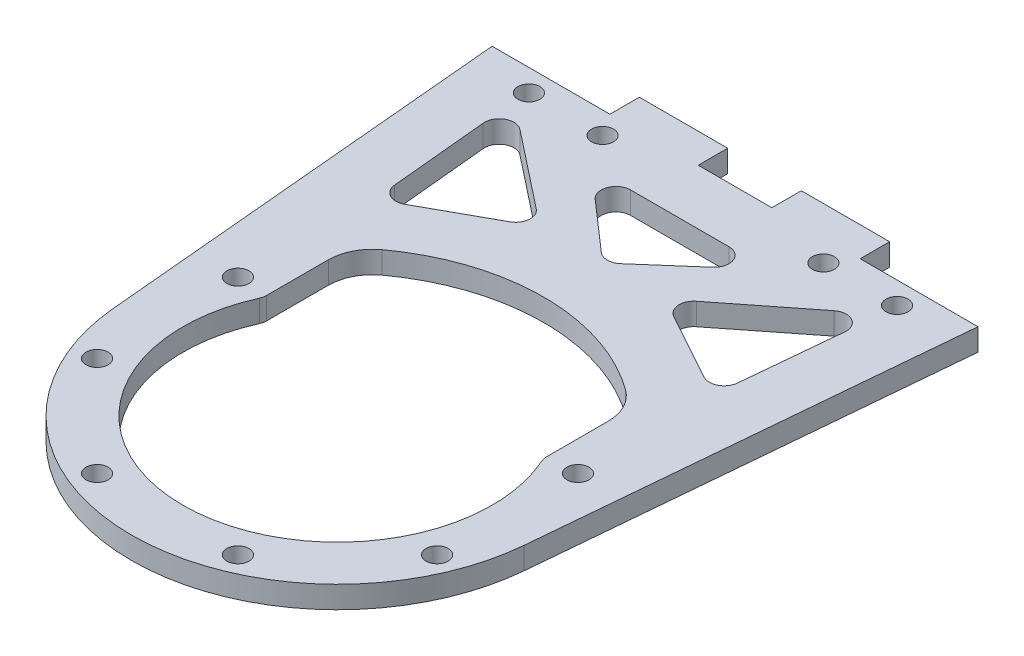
ISO-10303-21;
HEADER;
FILE_DESCRIPTION(('STEP AP214'),'2;1');
FILE_NAME('part.step','',(''),(''),'','','');
FILE_SCHEMA(('AUTOMOTIVE_DESIGN { 1 0 10303 214 1 1 1 1 }'));
ENDSEC;
DATA;
#1=APPLICATION_CONTEXT('core data for automotive mechanical design processes');
#2=APPLICATION_PROTOCOL_DEFINITION('international standard','automotive_design',2000,#1);
#3=PRODUCT_CONTEXT('',#1,'mechanical');
#4=PRODUCT('Part','Part','',(#3));
#5=PRODUCT_RELATED_PRODUCT_CATEGORY('part','',(#4));
#6=PRODUCT_DEFINITION_FORMATION('','',#4);
#7=PRODUCT_DEFINITION_CONTEXT('part definition',#1,'design');
#8=PRODUCT_DEFINITION('design','',#6,#7);
#9=PRODUCT_DEFINITION_SHAPE('','',#8);
#10=(LENGTH_UNIT() NAMED_UNIT(*) SI_UNIT(.MILLI.,.METRE.));
#11=(NAMED_UNIT(*) PLANE_ANGLE_UNIT() SI_UNIT($,.RADIAN.));
#12=(NAMED_UNIT(*) SI_UNIT($,.STERADIAN.) SOLID_ANGLE_UNIT());
#13=UNCERTAINTY_MEASURE_WITH_UNIT(LENGTH_MEASURE(1.E-05),#10,'distance_accuracy_value','');
#14=(GEOMETRIC_REPRESENTATION_CONTEXT(3) GLOBAL_UNCERTAINTY_ASSIGNED_CONTEXT((#13)) GLOBAL_UNIT_ASSIGNED_CONTEXT((#10,
#11,#12)) REPRESENTATION_CONTEXT('',''));
#15=CARTESIAN_POINT('',(0.,0.,0.));
#16=DIRECTION('',(0.,0.,1.));
#17=DIRECTION('',(1.,0.,0.));
#18=AXIS2_PLACEMENT_3D('',#15,#16,#17);
#19=CARTESIAN_POINT('',(0.,3.,0.));
#20=DIRECTION('',(0.,1.,0.));
#21=DIRECTION('',(0.,0.,1.));
#22=AXIS2_PLACEMENT_3D('',#19,#20,#21);
#23=PLANE('',#22);
#24=CARTESIAN_POINT('',(-25.,3.,-51.));
#25=DIRECTION('',(0.,1.,0.));
#26=DIRECTION('',(0.,0.,1.));
#27=AXIS2_PLACEMENT_3D('',#24,#25,#26);
#28=CIRCLE('',#27,1.5);
#29=CARTESIAN_POINT('',(-25.,3.,-49.5));
#30=VERTEX_POINT('',#29);
#31=EDGE_CURVE('E694',#30,#30,#28,.T.);
#32=ORIENTED_EDGE('',*,*,#31,.F.);
#33=EDGE_LOOP('',(#32));
#34=FACE_BOUND('',#33,.T.);
#35=CARTESIAN_POINT('',(15.,3.,-51.));
#36=DIRECTION('',(0.,1.,0.));
#37=DIRECTION('',(0.,0.,1.));
#38=AXIS2_PLACEMENT_3D('',#35,#36,#37);
#39=CIRCLE('',#38,1.5);
#40=CARTESIAN_POINT('',(15.,3.,-49.5));
#41=VERTEX_POINT('',#40);
#42=EDGE_CURVE('E698',#41,#41,#39,.T.);
#43=ORIENTED_EDGE('',*,*,#42,.F.);
#44=EDGE_LOOP('',(#43));
#45=FACE_BOUND('',#44,.T.);
#46=CARTESIAN_POINT('',(25.,3.,-51.));
#47=DIRECTION('',(0.,1.,0.));
#48=DIRECTION('',(0.,0.,1.));
#49=AXIS2_PLACEMENT_3D('',#46,#47,#48);
#50=CIRCLE('',#49,1.5);
#51=CARTESIAN_POINT('',(25.,3.,-49.5));
#52=VERTEX_POINT('',#51);
#53=EDGE_CURVE('E709',#52,#52,#50,.T.);
#54=ORIENTED_EDGE('',*,*,#53,.F.);
#55=EDGE_LOOP('',(#54));
#56=FACE_BOUND('',#55,.T.);
#57=CARTESIAN_POINT('',(-15.,3.,-51.));
#58=DIRECTION('',(0.,1.,0.));
#59=DIRECTION('',(0.,0.,1.));
#60=AXIS2_PLACEMENT_3D('',#57,#58,#59);
#61=CIRCLE('',#60,1.5);
#62=CARTESIAN_POINT('',(-15.,3.,-49.5));
#63=VERTEX_POINT('',#62);
#64=EDGE_CURVE('E697',#63,#63,#61,.T.);
#65=ORIENTED_EDGE('',*,*,#64,.F.);
#66=EDGE_LOOP('',(#65));
#67=FACE_BOUND('',#66,.T.);
#68=CARTESIAN_POINT('',(23.0969883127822,3.,9.56708580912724));
#69=DIRECTION('',(0.,1.,0.));
#70=DIRECTION('',(0.,0.,1.));
#71=AXIS2_PLACEMENT_3D('',#68,#69,#70);
#72=CIRCLE('',#71,1.5);
#73=CARTESIAN_POINT('',(23.0969883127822,3.,11.0670858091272));
#74=VERTEX_POINT('',#73);
#75=EDGE_CURVE('E463',#74,#74,#72,.T.);
#76=ORIENTED_EDGE('',*,*,#75,.F.);
#77=EDGE_LOOP('',(#76));
#78=FACE_BOUND('',#77,.T.);
#79=CARTESIAN_POINT('',(-23.0969883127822,3.,-9.56708580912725));
#80=DIRECTION('',(0.,1.,0.));
#81=DIRECTION('',(0.,0.,1.));
#82=AXIS2_PLACEMENT_3D('',#79,#80,#81);
#83=CIRCLE('',#82,1.5);
#84=CARTESIAN_POINT('',(-23.0969883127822,3.,-8.06708580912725));
#85=VERTEX_POINT('',#84);
#86=EDGE_CURVE('E475',#85,#85,#83,.T.);
#87=ORIENTED_EDGE('',*,*,#86,.F.);
#88=EDGE_LOOP('',(#87));
#89=FACE_BOUND('',#88,.T.);
#90=CARTESIAN_POINT('',(0.,3.,0.));
#91=DIRECTION('',(0.,1.,0.));
#92=DIRECTION('',(0.,0.,1.));
#93=AXIS2_PLACEMENT_3D('',#90,#91,#92);
#94=CIRCLE('',#93,28.);
#95=CARTESIAN_POINT('',(-27.8860993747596,3.,2.52298665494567));
#96=VERTEX_POINT('',#95);
#97=CARTESIAN_POINT('',(27.8860993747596,3.,2.52298665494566));
#98=VERTEX_POINT('',#97);
#99=EDGE_CURVE('E493',#96,#98,#94,.T.);
#100=ORIENTED_EDGE('',*,*,#99,.T.);
#101=DIRECTION('',(-0.0901066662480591,0.,0.995932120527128));
#102=VECTOR('',#101,1.);
#103=CARTESIAN_POINT('',(27.8860993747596,3.,2.52298665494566));
#104=LINE('',#103,#102);
#105=CARTESIAN_POINT('',(33.,3.,-54.));
#106=VERTEX_POINT('',#105);
#107=EDGE_CURVE('E368',#106,#98,#104,.T.);
#108=ORIENTED_EDGE('',*,*,#107,.F.);
#109=DIRECTION('',(1.,0.,0.));
#110=VECTOR('',#109,1.);
#111=CARTESIAN_POINT('',(0.,3.,-54.));
#112=LINE('',#111,#110);
#113=CARTESIAN_POINT('',(17.,3.,-54.));
#114=VERTEX_POINT('',#113);
#115=EDGE_CURVE('E361',#114,#106,#112,.T.);
#116=ORIENTED_EDGE('',*,*,#115,.F.);
#117=DIRECTION('',(0.,0.,-1.));
#118=VECTOR('',#117,1.);
#119=CARTESIAN_POINT('',(17.,3.,-54.));
#120=LINE('',#119,#118);
#121=CARTESIAN_POINT('',(17.,3.,-58.));
#122=VERTEX_POINT('',#121);
#123=EDGE_CURVE('E367',#114,#122,#120,.T.);
#124=ORIENTED_EDGE('',*,*,#123,.T.);
#125=DIRECTION('',(-1.,0.,0.));
#126=VECTOR('',#125,1.);
#127=CARTESIAN_POINT('',(17.,3.,-58.));
#128=LINE('',#127,#126);
#129=CARTESIAN_POINT('',(5.,3.,-58.));
#130=VERTEX_POINT('',#129);
#131=EDGE_CURVE('E389',#122,#130,#128,.T.);
#132=ORIENTED_EDGE('',*,*,#131,.T.);
#133=DIRECTION('',(0.,0.,1.));
#134=VECTOR('',#133,1.);
#135=CARTESIAN_POINT('',(5.,3.,-54.));
#136=LINE('',#135,#134);
#137=CARTESIAN_POINT('',(5.,3.,-54.));
#138=VERTEX_POINT('',#137);
#139=EDGE_CURVE('E394',#130,#138,#136,.T.);
#140=ORIENTED_EDGE('',*,*,#139,.T.);
#141=CARTESIAN_POINT('',(-5.,3.,-54.));
#142=VERTEX_POINT('',#141);
#143=EDGE_CURVE('E372',#142,#138,#112,.T.);
#144=ORIENTED_EDGE('',*,*,#143,.F.);
#145=DIRECTION('',(0.,0.,-1.));
#146=VECTOR('',#145,1.);
#147=CARTESIAN_POINT('',(-5.,3.,-54.));
#148=LINE('',#147,#146);
#149=CARTESIAN_POINT('',(-5.,3.,-58.));
#150=VERTEX_POINT('',#149);
#151=EDGE_CURVE('E392',#142,#150,#148,.T.);
#152=ORIENTED_EDGE('',*,*,#151,.T.);
#153=DIRECTION('',(-1.,0.,0.));
#154=VECTOR('',#153,1.);
#155=CARTESIAN_POINT('',(-17.,3.,-58.));
#156=LINE('',#155,#154);
#157=CARTESIAN_POINT('',(-17.,3.,-58.));
#158=VERTEX_POINT('',#157);
#159=EDGE_CURVE('E409',#150,#158,#156,.T.);
#160=ORIENTED_EDGE('',*,*,#159,.T.);
#161=DIRECTION('',(0.,0.,1.));
#162=VECTOR('',#161,1.);
#163=CARTESIAN_POINT('',(-17.,3.,-54.));
#164=LINE('',#163,#162);
#165=CARTESIAN_POINT('',(-17.,3.,-54.));
#166=VERTEX_POINT('',#165);
#167=EDGE_CURVE('E388',#158,#166,#164,.T.);
#168=ORIENTED_EDGE('',*,*,#167,.T.);
#169=CARTESIAN_POINT('',(-33.,3.,-54.));
#170=VERTEX_POINT('',#169);
#171=EDGE_CURVE('E374',#170,#166,#112,.T.);
#172=ORIENTED_EDGE('',*,*,#171,.F.);
#173=DIRECTION('',(0.0901066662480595,0.,0.995932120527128));
#174=VECTOR('',#173,1.);
#175=CARTESIAN_POINT('',(-27.8860993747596,3.,2.52298665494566));
#176=LINE('',#175,#174);
#177=EDGE_CURVE('E430',#170,#96,#176,.T.);
#178=ORIENTED_EDGE('',*,*,#177,.T.);
#179=EDGE_LOOP('',(#100,#108,#116,#124,#132,#140,#144,#152,#160,#168,#172,#178));
#180=FACE_BOUND('',#179,.T.);
#181=CARTESIAN_POINT('',(-9.56708580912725,3.,23.0969883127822));
#182=DIRECTION('',(0.,1.,0.));
#183=DIRECTION('',(0.,0.,1.));
#184=AXIS2_PLACEMENT_3D('',#181,#182,#183);
#185=CIRCLE('',#184,1.5);
#186=CARTESIAN_POINT('',(-9.56708580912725,3.,24.5969883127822));
#187=VERTEX_POINT('',#186);
#188=EDGE_CURVE('E487',#187,#187,#185,.T.);
#189=ORIENTED_EDGE('',*,*,#188,.F.);
#190=EDGE_LOOP('',(#189));
#191=FACE_BOUND('',#190,.T.);
#192=CARTESIAN_POINT('',(-23.0969883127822,3.,9.56708580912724));
#193=DIRECTION('',(0.,1.,0.));
#194=DIRECTION('',(0.,0.,1.));
#195=AXIS2_PLACEMENT_3D('',#192,#193,#194);
#196=CIRCLE('',#195,1.5);
#197=CARTESIAN_POINT('',(-23.0969883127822,3.,11.0670858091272));
#198=VERTEX_POINT('',#197);
#199=EDGE_CURVE('E481',#198,#198,#196,.T.);
#200=ORIENTED_EDGE('',*,*,#199,.F.);
#201=EDGE_LOOP('',(#200));
#202=FACE_BOUND('',#201,.T.);
#203=CARTESIAN_POINT('',(23.0969883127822,3.,-9.56708580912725));
#204=DIRECTION('',(0.,1.,0.));
#205=DIRECTION('',(0.,0.,1.));
#206=AXIS2_PLACEMENT_3D('',#203,#204,#205);
#207=CIRCLE('',#206,1.5);
#208=CARTESIAN_POINT('',(23.0969883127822,3.,-8.06708580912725));
#209=VERTEX_POINT('',#208);
#210=EDGE_CURVE('E469',#209,#209,#207,.T.);
#211=ORIENTED_EDGE('',*,*,#210,.F.);
#212=EDGE_LOOP('',(#211));
#213=FACE_BOUND('',#212,.T.);
#214=CARTESIAN_POINT('',(9.56708580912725,3.,23.0969883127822));
#215=DIRECTION('',(0.,1.,0.));
#216=DIRECTION('',(0.,0.,1.));
#217=AXIS2_PLACEMENT_3D('',#214,#215,#216);
#218=CIRCLE('',#217,1.5);
#219=CARTESIAN_POINT('',(9.56708580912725,3.,24.5969883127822));
#220=VERTEX_POINT('',#219);
#221=EDGE_CURVE('E457',#220,#220,#218,.T.);
#222=ORIENTED_EDGE('',*,*,#221,.F.);
#223=EDGE_LOOP('',(#222));
#224=FACE_BOUND('',#223,.T.);
#225=DIRECTION('',(1.,0.,0.));
#226=VECTOR('',#225,1.);
#227=CARTESIAN_POINT('',(0.,3.,-46.5));
#228=LINE('',#227,#226);
#229=CARTESIAN_POINT('',(-6.67710119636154,3.,-46.5));
#230=VERTEX_POINT('',#229);
#231=CARTESIAN_POINT('',(6.67710119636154,3.,-46.5));
#232=VERTEX_POINT('',#231);
#233=EDGE_CURVE('E678',#230,#232,#228,.T.);
#234=ORIENTED_EDGE('',*,*,#233,.T.);
#235=CARTESIAN_POINT('',(6.67710119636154,3.,-44.5));
#236=DIRECTION('',(0.,1.,0.));
#237=DIRECTION('',(0.,0.,1.));
#238=AXIS2_PLACEMENT_3D('',#235,#236,#237);
#239=CIRCLE('',#238,2.);
#240=CARTESIAN_POINT('',(7.99411041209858,3.,-42.9948466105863));
#241=VERTEX_POINT('',#240);
#242=EDGE_CURVE('E567',#232,#241,#239,.F.);
#243=ORIENTED_EDGE('',*,*,#242,.T.);
#244=DIRECTION('',(-0.752576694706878,0.,0.658504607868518));
#245=VECTOR('',#244,1.);
#246=CARTESIAN_POINT('',(-17.8407079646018,3.,-20.3893805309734));
#247=LINE('',#246,#245);
#248=CARTESIAN_POINT('',(1.31700921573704,3.,-37.1523830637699));
#249=VERTEX_POINT('',#248);
#250=EDGE_CURVE('E687',#241,#249,#247,.T.);
#251=ORIENTED_EDGE('',*,*,#250,.T.);
#252=CARTESIAN_POINT('',(0.,3.,-38.6575364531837));
#253=DIRECTION('',(0.,1.,0.));
#254=DIRECTION('',(0.,0.,1.));
#255=AXIS2_PLACEMENT_3D('',#252,#253,#254);
#256=CIRCLE('',#255,2.);
#257=CARTESIAN_POINT('',(-1.31700921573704,3.,-37.1523830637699));
#258=VERTEX_POINT('',#257);
#259=EDGE_CURVE('E563',#249,#258,#256,.F.);
#260=ORIENTED_EDGE('',*,*,#259,.T.);
#261=DIRECTION('',(-0.752576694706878,0.,-0.658504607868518));
#262=VECTOR('',#261,1.);
#263=CARTESIAN_POINT('',(17.8407079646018,3.,-20.3893805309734));
#264=LINE('',#263,#262);
#265=CARTESIAN_POINT('',(-7.99411041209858,3.,-42.9948466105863));
#266=VERTEX_POINT('',#265);
#267=EDGE_CURVE('E651',#258,#266,#264,.T.);
#268=ORIENTED_EDGE('',*,*,#267,.T.);
#269=CARTESIAN_POINT('',(-6.67710119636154,3.,-44.5));
#270=DIRECTION('',(0.,1.,0.));
#271=DIRECTION('',(0.,0.,1.));
#272=AXIS2_PLACEMENT_3D('',#269,#270,#271);
#273=CIRCLE('',#272,2.);
#274=EDGE_CURVE('E595',#266,#230,#273,.F.);
#275=ORIENTED_EDGE('',*,*,#274,.T.);
#276=EDGE_LOOP('',(#234,#243,#251,#260,#268,#275));
#277=FACE_BOUND('',#276,.T.);
#278=CARTESIAN_POINT('',(0.,3.,0.));
#279=DIRECTION('',(0.,1.,0.));
#280=DIRECTION('',(0.,0.,1.));
#281=AXIS2_PLACEMENT_3D('',#278,#279,#280);
#282=CIRCLE('',#281,28.);
#283=CARTESIAN_POINT('',(16.5454545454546,3.,-22.588668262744));
#284=VERTEX_POINT('',#283);
#285=CARTESIAN_POINT('',(-16.5454545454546,3.,-22.588668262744));
#286=VERTEX_POINT('',#285);
#287=EDGE_CURVE('E616',#284,#286,#282,.T.);
#288=ORIENTED_EDGE('',*,*,#287,.F.);
#289=CARTESIAN_POINT('',(13.,3.,-17.7482393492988));
#290=DIRECTION('',(0.,1.,0.));
#291=DIRECTION('',(0.,0.,1.));
#292=AXIS2_PLACEMENT_3D('',#289,#290,#291);
#293=CIRCLE('',#292,6.);
#294=CARTESIAN_POINT('',(19.,3.,-17.7482393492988));
#295=VERTEX_POINT('',#294);
#296=EDGE_CURVE('E608',#284,#295,#293,.F.);
#297=ORIENTED_EDGE('',*,*,#296,.T.);
#298=DIRECTION('',(0.,0.,1.));
#299=VECTOR('',#298,1.);
#300=CARTESIAN_POINT('',(19.,3.,0.));
#301=LINE('',#300,#299);
#302=CARTESIAN_POINT('',(19.,3.,-9.38083151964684));
#303=VERTEX_POINT('',#302);
#304=EDGE_CURVE('E622',#295,#303,#301,.T.);
#305=ORIENTED_EDGE('',*,*,#304,.T.);
#306=CARTESIAN_POINT('',(21.,3.,-9.38083151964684));
#307=DIRECTION('',(0.,1.,0.));
#308=DIRECTION('',(0.,0.,1.));
#309=AXIS2_PLACEMENT_3D('',#306,#307,#308);
#310=CIRCLE('',#309,2.);
#311=CARTESIAN_POINT('',(19.1739130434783,3.,-8.56510703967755));
#312=VERTEX_POINT('',#311);
#313=EDGE_CURVE('E503',#303,#312,#310,.T.);
#314=ORIENTED_EDGE('',*,*,#313,.T.);
#315=CARTESIAN_POINT('',(0.,3.,0.));
#316=DIRECTION('',(0.,1.,0.));
#317=DIRECTION('',(0.,0.,1.));
#318=AXIS2_PLACEMENT_3D('',#315,#316,#317);
#319=CIRCLE('',#318,21.);
#320=CARTESIAN_POINT('',(-19.1739130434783,3.,-8.56510703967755));
#321=VERTEX_POINT('',#320);
#322=EDGE_CURVE('E453',#321,#312,#319,.T.);
#323=ORIENTED_EDGE('',*,*,#322,.F.);
#324=CARTESIAN_POINT('',(-21.,3.,-9.38083151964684));
#325=DIRECTION('',(0.,1.,0.));
#326=DIRECTION('',(0.,0.,1.));
#327=AXIS2_PLACEMENT_3D('',#324,#325,#326);
#328=CIRCLE('',#327,2.);
#329=CARTESIAN_POINT('',(-19.,3.,-9.38083151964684));
#330=VERTEX_POINT('',#329);
#331=EDGE_CURVE('E500',#321,#330,#328,.T.);
#332=ORIENTED_EDGE('',*,*,#331,.T.);
#333=DIRECTION('',(0.,0.,1.));
#334=VECTOR('',#333,1.);
#335=CARTESIAN_POINT('',(-19.,3.,0.));
#336=LINE('',#335,#334);
#337=CARTESIAN_POINT('',(-19.,3.,-17.7482393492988));
#338=VERTEX_POINT('',#337);
#339=EDGE_CURVE('E617',#338,#330,#336,.T.);
#340=ORIENTED_EDGE('',*,*,#339,.F.);
#341=CARTESIAN_POINT('',(-13.,3.,-17.7482393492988));
#342=DIRECTION('',(0.,1.,0.));
#343=DIRECTION('',(0.,0.,1.));
#344=AXIS2_PLACEMENT_3D('',#341,#342,#343);
#345=CIRCLE('',#344,6.);
#346=EDGE_CURVE('E125',#338,#286,#345,.F.);
#347=ORIENTED_EDGE('',*,*,#346,.T.);
#348=EDGE_LOOP('',(#288,#297,#305,#314,#323,#332,#340,#347));
#349=FACE_BOUND('',#348,.T.);
#350=DIRECTION('',(-0.0948090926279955,0.,0.995495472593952));
#351=VECTOR('',#350,1.);
#352=CARTESIAN_POINT('',(20.1505617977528,3.,1.91910112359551));
#353=LINE('',#352,#351);
#354=CARTESIAN_POINT('',(24.5567957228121,3.,-44.3463550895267));
#355=VERTEX_POINT('',#354);
#356=CARTESIAN_POINT('',(23.2889201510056,3.,-31.0336615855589));
#357=VERTEX_POINT('',#356);
#358=EDGE_CURVE('E665',#355,#357,#353,.T.);
#359=ORIENTED_EDGE('',*,*,#358,.T.);
#360=CARTESIAN_POINT('',(21.2979292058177,3.,-31.2232797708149));
#361=DIRECTION('',(0.,1.,0.));
#362=DIRECTION('',(0.,0.,1.));
#363=AXIS2_PLACEMENT_3D('',#360,#361,#362);
#364=CIRCLE('',#363,2.);
#365=CARTESIAN_POINT('',(20.331774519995,3.,-29.4721244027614));
#366=VERTEX_POINT('',#365);
#367=EDGE_CURVE('E575',#357,#366,#364,.F.);
#368=ORIENTED_EDGE('',*,*,#367,.T.);
#369=DIRECTION('',(-0.875577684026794,0.,-0.483077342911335));
#370=VECTOR('',#369,1.);
#371=CARTESIAN_POINT('',(17.2105742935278,3.,-31.1941659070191));
#372=LINE('',#371,#370);
#373=CARTESIAN_POINT('',(11.1396766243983,3.,-34.5436266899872));
#374=VERTEX_POINT('',#373);
#375=EDGE_CURVE('E633',#366,#374,#372,.T.);
#376=ORIENTED_EDGE('',*,*,#375,.T.);
#377=CARTESIAN_POINT('',(12.1058313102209,3.,-36.2947820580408));
#378=DIRECTION('',(0.,1.,0.));
#379=DIRECTION('',(0.,0.,1.));
#380=AXIS2_PLACEMENT_3D('',#377,#378,#379);
#381=CIRCLE('',#380,2.);
#382=CARTESIAN_POINT('',(10.8680868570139,3.,-37.8657654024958));
#383=VERTEX_POINT('',#382);
#384=EDGE_CURVE('E571',#374,#383,#381,.F.);
#385=ORIENTED_EDGE('',*,*,#384,.T.);
#386=DIRECTION('',(0.785491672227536,0.,-0.618872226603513));
#387=VECTOR('',#386,1.);
#388=CARTESIAN_POINT('',(-14.2447592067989,3.,-18.0798866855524));
#389=LINE('',#388,#387);
#390=CARTESIAN_POINT('',(21.3280603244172,3.,-46.1069566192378));
#391=VERTEX_POINT('',#390);
#392=EDGE_CURVE('E629',#383,#391,#389,.T.);
#393=ORIENTED_EDGE('',*,*,#392,.T.);
#394=CARTESIAN_POINT('',(22.5658047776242,3.,-44.5359732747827));
#395=DIRECTION('',(0.,1.,0.));
#396=DIRECTION('',(0.,0.,1.));
#397=AXIS2_PLACEMENT_3D('',#394,#395,#396);
#398=CIRCLE('',#397,2.);
#399=EDGE_CURVE('E579',#391,#355,#398,.F.);
#400=ORIENTED_EDGE('',*,*,#399,.T.);
#401=EDGE_LOOP('',(#359,#368,#376,#385,#393,#400));
#402=FACE_BOUND('',#401,.T.);
#403=DIRECTION('',(0.785491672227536,0.,0.618872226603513));
#404=VECTOR('',#403,1.);
#405=CARTESIAN_POINT('',(14.2447592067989,3.,-18.0798866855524));
#406=LINE('',#405,#404);
#407=CARTESIAN_POINT('',(-21.3280603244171,3.,-46.1069566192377));
#408=VERTEX_POINT('',#407);
#409=CARTESIAN_POINT('',(-10.8680868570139,3.,-37.8657654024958));
#410=VERTEX_POINT('',#409);
#411=EDGE_CURVE('E645',#408,#410,#406,.T.);
#412=ORIENTED_EDGE('',*,*,#411,.T.);
#413=CARTESIAN_POINT('',(-12.1058313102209,3.,-36.2947820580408));
#414=DIRECTION('',(0.,1.,0.));
#415=DIRECTION('',(0.,0.,1.));
#416=AXIS2_PLACEMENT_3D('',#413,#414,#415);
#417=CIRCLE('',#416,2.);
#418=CARTESIAN_POINT('',(-11.1396766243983,3.,-34.5436266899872));
#419=VERTEX_POINT('',#418);
#420=EDGE_CURVE('E587',#410,#419,#417,.F.);
#421=ORIENTED_EDGE('',*,*,#420,.T.);
#422=DIRECTION('',(-0.875577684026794,0.,0.483077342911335));
#423=VECTOR('',#422,1.);
#424=CARTESIAN_POINT('',(-17.2105742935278,3.,-31.1941659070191));
#425=LINE('',#424,#423);
#426=CARTESIAN_POINT('',(-20.331774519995,3.,-29.4721244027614));
#427=VERTEX_POINT('',#426);
#428=EDGE_CURVE('E655',#419,#427,#425,.T.);
#429=ORIENTED_EDGE('',*,*,#428,.T.);
#430=CARTESIAN_POINT('',(-21.2979292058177,3.,-31.2232797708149));
#431=DIRECTION('',(0.,1.,0.));
#432=DIRECTION('',(0.,0.,1.));
#433=AXIS2_PLACEMENT_3D('',#430,#431,#432);
#434=CIRCLE('',#433,2.);
#435=CARTESIAN_POINT('',(-23.2889201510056,3.,-31.033661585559));
#436=VERTEX_POINT('',#435);
#437=EDGE_CURVE('E583',#427,#436,#434,.F.);
#438=ORIENTED_EDGE('',*,*,#437,.T.);
#439=DIRECTION('',(-0.0948090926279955,0.,-0.995495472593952));
#440=VECTOR('',#439,1.);
#441=CARTESIAN_POINT('',(-20.1505617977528,3.,1.91910112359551));
#442=LINE('',#441,#440);
#443=CARTESIAN_POINT('',(-24.5567957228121,3.,-44.3463550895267));
#444=VERTEX_POINT('',#443);
#445=EDGE_CURVE('E652',#436,#444,#442,.T.);
#446=ORIENTED_EDGE('',*,*,#445,.T.);
#447=CARTESIAN_POINT('',(-22.5658047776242,3.,-44.5359732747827));
#448=DIRECTION('',(0.,1.,0.));
#449=DIRECTION('',(0.,0.,1.));
#450=AXIS2_PLACEMENT_3D('',#447,#448,#449);
#451=CIRCLE('',#450,2.);
#452=EDGE_CURVE('E591',#444,#408,#451,.F.);
#453=ORIENTED_EDGE('',*,*,#452,.T.);
#454=EDGE_LOOP('',(#412,#421,#429,#438,#446,#453));
#455=FACE_BOUND('',#454,.T.);
#456=ADVANCED_FACE('F117',(#34,#45,#56,#67,#78,#89,#180,#191,#202,#213,#224,#277,#349,#402,
#455),#23,.T.);
#457=CARTESIAN_POINT('',(0.,0.,0.));
#458=DIRECTION('',(0.,1.,0.));
#459=DIRECTION('',(0.,0.,1.));
#460=AXIS2_PLACEMENT_3D('',#457,#458,#459);
#461=PLANE('',#460);
#462=DIRECTION('',(0.785491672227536,0.,-0.618872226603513));
#463=VECTOR('',#462,1.);
#464=CARTESIAN_POINT('',(-14.2447592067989,0.,-18.0798866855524));
#465=LINE('',#464,#463);
#466=CARTESIAN_POINT('',(10.8680868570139,0.,-37.8657654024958));
#467=VERTEX_POINT('',#466);
#468=CARTESIAN_POINT('',(21.3280603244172,0.,-46.1069566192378));
#469=VERTEX_POINT('',#468);
#470=EDGE_CURVE('E661',#467,#469,#465,.T.);
#471=ORIENTED_EDGE('',*,*,#470,.F.);
#472=CARTESIAN_POINT('',(12.1058313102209,0.,-36.2947820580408));
#473=DIRECTION('',(0.,1.,0.));
#474=DIRECTION('',(0.,0.,1.));
#475=AXIS2_PLACEMENT_3D('',#472,#473,#474);
#476=CIRCLE('',#475,2.);
#477=CARTESIAN_POINT('',(11.1396766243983,0.,-34.5436266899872));
#478=VERTEX_POINT('',#477);
#479=EDGE_CURVE('E573',#467,#478,#476,.T.);
#480=ORIENTED_EDGE('',*,*,#479,.T.);
#481=DIRECTION('',(-0.875577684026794,0.,-0.483077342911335));
#482=VECTOR('',#481,1.);
#483=CARTESIAN_POINT('',(17.2105742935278,0.,-31.1941659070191));
#484=LINE('',#483,#482);
#485=CARTESIAN_POINT('',(20.331774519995,0.,-29.4721244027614));
#486=VERTEX_POINT('',#485);
#487=EDGE_CURVE('E664',#486,#478,#484,.T.);
#488=ORIENTED_EDGE('',*,*,#487,.F.);
#489=CARTESIAN_POINT('',(21.2979292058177,0.,-31.2232797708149));
#490=DIRECTION('',(0.,1.,0.));
#491=DIRECTION('',(0.,0.,1.));
#492=AXIS2_PLACEMENT_3D('',#489,#490,#491);
#493=CIRCLE('',#492,2.);
#494=CARTESIAN_POINT('',(23.2889201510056,0.,-31.0336615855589));
#495=VERTEX_POINT('',#494);
#496=EDGE_CURVE('E577',#486,#495,#493,.T.);
#497=ORIENTED_EDGE('',*,*,#496,.T.);
#498=DIRECTION('',(-0.0948090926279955,0.,0.995495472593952));
#499=VECTOR('',#498,1.);
#500=CARTESIAN_POINT('',(20.1505617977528,0.,1.91910112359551));
#501=LINE('',#500,#499);
#502=CARTESIAN_POINT('',(24.5567957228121,0.,-44.3463550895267));
#503=VERTEX_POINT('',#502);
#504=EDGE_CURVE('E656',#503,#495,#501,.T.);
#505=ORIENTED_EDGE('',*,*,#504,.F.);
#506=CARTESIAN_POINT('',(22.5658047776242,0.,-44.5359732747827));
#507=DIRECTION('',(0.,1.,0.));
#508=DIRECTION('',(0.,0.,1.));
#509=AXIS2_PLACEMENT_3D('',#506,#507,#508);
#510=CIRCLE('',#509,2.);
#511=EDGE_CURVE('E581',#503,#469,#510,.T.);
#512=ORIENTED_EDGE('',*,*,#511,.T.);
#513=EDGE_LOOP('',(#471,#480,#488,#497,#505,#512));
#514=FACE_BOUND('',#513,.T.);
#515=DIRECTION('',(-0.752576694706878,0.,-0.658504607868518));
#516=VECTOR('',#515,1.);
#517=CARTESIAN_POINT('',(17.8407079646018,0.,-20.3893805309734));
#518=LINE('',#517,#516);
#519=CARTESIAN_POINT('',(-1.31700921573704,0.,-37.1523830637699));
#520=VERTEX_POINT('',#519);
#521=CARTESIAN_POINT('',(-7.99411041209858,0.,-42.9948466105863));
#522=VERTEX_POINT('',#521);
#523=EDGE_CURVE('E674',#520,#522,#518,.T.);
#524=ORIENTED_EDGE('',*,*,#523,.F.);
#525=CARTESIAN_POINT('',(0.,0.,-38.6575364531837));
#526=DIRECTION('',(0.,1.,0.));
#527=DIRECTION('',(0.,0.,1.));
#528=AXIS2_PLACEMENT_3D('',#525,#526,#527);
#529=CIRCLE('',#528,2.);
#530=CARTESIAN_POINT('',(1.31700921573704,0.,-37.1523830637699));
#531=VERTEX_POINT('',#530);
#532=EDGE_CURVE('E565',#520,#531,#529,.T.);
#533=ORIENTED_EDGE('',*,*,#532,.T.);
#534=DIRECTION('',(-0.752576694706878,0.,0.658504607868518));
#535=VECTOR('',#534,1.);
#536=CARTESIAN_POINT('',(-17.8407079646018,0.,-20.3893805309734));
#537=LINE('',#536,#535);
#538=CARTESIAN_POINT('',(7.99411041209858,0.,-42.9948466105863));
#539=VERTEX_POINT('',#538);
#540=EDGE_CURVE('E677',#539,#531,#537,.T.);
#541=ORIENTED_EDGE('',*,*,#540,.F.);
#542=CARTESIAN_POINT('',(6.67710119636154,0.,-44.5));
#543=DIRECTION('',(0.,1.,0.));
#544=DIRECTION('',(0.,0.,1.));
#545=AXIS2_PLACEMENT_3D('',#542,#543,#544);
#546=CIRCLE('',#545,2.);
#547=CARTESIAN_POINT('',(6.67710119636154,0.,-46.5));
#548=VERTEX_POINT('',#547);
#549=EDGE_CURVE('E569',#539,#548,#546,.T.);
#550=ORIENTED_EDGE('',*,*,#549,.T.);
#551=DIRECTION('',(1.,0.,0.));
#552=VECTOR('',#551,1.);
#553=CARTESIAN_POINT('',(0.,0.,-46.5));
#554=LINE('',#553,#552);
#555=CARTESIAN_POINT('',(-6.67710119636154,0.,-46.5));
#556=VERTEX_POINT('',#555);
#557=EDGE_CURVE('E681',#556,#548,#554,.T.);
#558=ORIENTED_EDGE('',*,*,#557,.F.);
#559=CARTESIAN_POINT('',(-6.67710119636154,0.,-44.5));
#560=DIRECTION('',(0.,1.,0.));
#561=DIRECTION('',(0.,0.,1.));
#562=AXIS2_PLACEMENT_3D('',#559,#560,#561);
#563=CIRCLE('',#562,2.);
#564=EDGE_CURVE('E597',#556,#522,#563,.T.);
#565=ORIENTED_EDGE('',*,*,#564,.T.);
#566=EDGE_LOOP('',(#524,#533,#541,#550,#558,#565));
#567=FACE_BOUND('',#566,.T.);
#568=CARTESIAN_POINT('',(-25.,0.,-51.));
#569=DIRECTION('',(0.,1.,0.));
#570=DIRECTION('',(0.,0.,1.));
#571=AXIS2_PLACEMENT_3D('',#568,#569,#570);
#572=CIRCLE('',#571,1.5);
#573=CARTESIAN_POINT('',(-25.,0.,-49.5));
#574=VERTEX_POINT('',#573);
#575=EDGE_CURVE('E383',#574,#574,#572,.T.);
#576=ORIENTED_EDGE('',*,*,#575,.T.);
#577=EDGE_LOOP('',(#576));
#578=FACE_BOUND('',#577,.T.);
#579=CARTESIAN_POINT('',(15.,0.,-51.));
#580=DIRECTION('',(0.,1.,0.));
#581=DIRECTION('',(0.,0.,1.));
#582=AXIS2_PLACEMENT_3D('',#579,#580,#581);
#583=CIRCLE('',#582,1.5);
#584=CARTESIAN_POINT('',(15.,0.,-49.5));
#585=VERTEX_POINT('',#584);
#586=EDGE_CURVE('E684',#585,#585,#583,.T.);
#587=ORIENTED_EDGE('',*,*,#586,.T.);
#588=EDGE_LOOP('',(#587));
#589=FACE_BOUND('',#588,.T.);
#590=CARTESIAN_POINT('',(25.,0.,-51.));
#591=DIRECTION('',(0.,1.,0.));
#592=DIRECTION('',(0.,0.,1.));
#593=AXIS2_PLACEMENT_3D('',#590,#591,#592);
#594=CIRCLE('',#593,1.5);
#595=CARTESIAN_POINT('',(25.,0.,-49.5));
#596=VERTEX_POINT('',#595);
#597=EDGE_CURVE('E701',#596,#596,#594,.T.);
#598=ORIENTED_EDGE('',*,*,#597,.T.);
#599=EDGE_LOOP('',(#598));
#600=FACE_BOUND('',#599,.T.);
#601=CARTESIAN_POINT('',(-15.,0.,-51.));
#602=DIRECTION('',(0.,1.,0.));
#603=DIRECTION('',(0.,0.,1.));
#604=AXIS2_PLACEMENT_3D('',#601,#602,#603);
#605=CIRCLE('',#604,1.5);
#606=CARTESIAN_POINT('',(-15.,0.,-49.5));
#607=VERTEX_POINT('',#606);
#608=EDGE_CURVE('E706',#607,#607,#605,.T.);
#609=ORIENTED_EDGE('',*,*,#608,.T.);
#610=EDGE_LOOP('',(#609));
#611=FACE_BOUND('',#610,.T.);
#612=CARTESIAN_POINT('',(0.,0.,0.));
#613=DIRECTION('',(0.,1.,0.));
#614=DIRECTION('',(0.,0.,1.));
#615=AXIS2_PLACEMENT_3D('',#612,#613,#614);
#616=CIRCLE('',#615,28.);
#617=CARTESIAN_POINT('',(-27.8860993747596,0.,2.52298665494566));
#618=VERTEX_POINT('',#617);
#619=CARTESIAN_POINT('',(27.8860993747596,0.,2.52298665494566));
#620=VERTEX_POINT('',#619);
#621=EDGE_CURVE('E490',#618,#620,#616,.T.);
#622=ORIENTED_EDGE('',*,*,#621,.F.);
#623=DIRECTION('',(0.0901066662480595,0.,0.995932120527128));
#624=VECTOR('',#623,1.);
#625=CARTESIAN_POINT('',(-27.8860993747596,0.,2.52298665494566));
#626=LINE('',#625,#624);
#627=CARTESIAN_POINT('',(-33.,0.,-54.));
#628=VERTEX_POINT('',#627);
#629=EDGE_CURVE('E434',#628,#618,#626,.T.);
#630=ORIENTED_EDGE('',*,*,#629,.F.);
#631=DIRECTION('',(1.,0.,0.));
#632=VECTOR('',#631,1.);
#633=CARTESIAN_POINT('',(0.,0.,-54.));
#634=LINE('',#633,#632);
#635=CARTESIAN_POINT('',(-17.,0.,-54.));
#636=VERTEX_POINT('',#635);
#637=EDGE_CURVE('E431',#628,#636,#634,.T.);
#638=ORIENTED_EDGE('',*,*,#637,.T.);
#639=DIRECTION('',(0.,0.,1.));
#640=VECTOR('',#639,1.);
#641=CARTESIAN_POINT('',(-17.,0.,-54.));
#642=LINE('',#641,#640);
#643=CARTESIAN_POINT('',(-17.,0.,-58.));
#644=VERTEX_POINT('',#643);
#645=EDGE_CURVE('E406',#644,#636,#642,.T.);
#646=ORIENTED_EDGE('',*,*,#645,.F.);
#647=DIRECTION('',(-1.,0.,0.));
#648=VECTOR('',#647,1.);
#649=CARTESIAN_POINT('',(-17.,0.,-58.));
#650=LINE('',#649,#648);
#651=CARTESIAN_POINT('',(-5.,0.,-58.));
#652=VERTEX_POINT('',#651);
#653=EDGE_CURVE('E412',#652,#644,#650,.T.);
#654=ORIENTED_EDGE('',*,*,#653,.F.);
#655=DIRECTION('',(0.,0.,-1.));
#656=VECTOR('',#655,1.);
#657=CARTESIAN_POINT('',(-5.,0.,-54.));
#658=LINE('',#657,#656);
#659=CARTESIAN_POINT('',(-5.,0.,-54.));
#660=VERTEX_POINT('',#659);
#661=EDGE_CURVE('E408',#660,#652,#658,.T.);
#662=ORIENTED_EDGE('',*,*,#661,.F.);
#663=CARTESIAN_POINT('',(5.,0.,-54.));
#664=VERTEX_POINT('',#663);
#665=EDGE_CURVE('E435',#660,#664,#634,.T.);
#666=ORIENTED_EDGE('',*,*,#665,.T.);
#667=DIRECTION('',(0.,0.,1.));
#668=VECTOR('',#667,1.);
#669=CARTESIAN_POINT('',(5.,0.,-54.));
#670=LINE('',#669,#668);
#671=CARTESIAN_POINT('',(5.,0.,-58.));
#672=VERTEX_POINT('',#671);
#673=EDGE_CURVE('E398',#672,#664,#670,.T.);
#674=ORIENTED_EDGE('',*,*,#673,.F.);
#675=DIRECTION('',(-1.,0.,0.));
#676=VECTOR('',#675,1.);
#677=CARTESIAN_POINT('',(17.,0.,-58.));
#678=LINE('',#677,#676);
#679=CARTESIAN_POINT('',(17.,0.,-58.));
#680=VERTEX_POINT('',#679);
#681=EDGE_CURVE('E401',#680,#672,#678,.T.);
#682=ORIENTED_EDGE('',*,*,#681,.F.);
#683=DIRECTION('',(0.,0.,-1.));
#684=VECTOR('',#683,1.);
#685=CARTESIAN_POINT('',(17.,0.,-54.));
#686=LINE('',#685,#684);
#687=CARTESIAN_POINT('',(17.,0.,-54.));
#688=VERTEX_POINT('',#687);
#689=EDGE_CURVE('E404',#688,#680,#686,.T.);
#690=ORIENTED_EDGE('',*,*,#689,.F.);
#691=CARTESIAN_POINT('',(33.,0.,-54.));
#692=VERTEX_POINT('',#691);
#693=EDGE_CURVE('E378',#688,#692,#634,.T.);
#694=ORIENTED_EDGE('',*,*,#693,.T.);
#695=DIRECTION('',(-0.0901066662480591,0.,0.995932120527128));
#696=VECTOR('',#695,1.);
#697=CARTESIAN_POINT('',(27.8860993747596,0.,2.52298665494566));
#698=LINE('',#697,#696);
#699=EDGE_CURVE('E428',#692,#620,#698,.T.);
#700=ORIENTED_EDGE('',*,*,#699,.T.);
#701=EDGE_LOOP('',(#622,#630,#638,#646,#654,#662,#666,#674,#682,#690,#694,#700));
#702=FACE_BOUND('',#701,.T.);
#703=CARTESIAN_POINT('',(-9.56708580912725,0.,23.0969883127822));
#704=DIRECTION('',(0.,1.,0.));
#705=DIRECTION('',(0.,0.,1.));
#706=AXIS2_PLACEMENT_3D('',#703,#704,#705);
#707=CIRCLE('',#706,1.5);
#708=CARTESIAN_POINT('',(-9.56708580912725,0.,24.5969883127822));
#709=VERTEX_POINT('',#708);
#710=EDGE_CURVE('E484',#709,#709,#707,.T.);
#711=ORIENTED_EDGE('',*,*,#710,.T.);
#712=EDGE_LOOP('',(#711));
#713=FACE_BOUND('',#712,.T.);
#714=CARTESIAN_POINT('',(-23.0969883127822,0.,9.56708580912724));
#715=DIRECTION('',(0.,1.,0.));
#716=DIRECTION('',(0.,0.,1.));
#717=AXIS2_PLACEMENT_3D('',#714,#715,#716);
#718=CIRCLE('',#717,1.5);
#719=CARTESIAN_POINT('',(-23.0969883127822,0.,11.0670858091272));
#720=VERTEX_POINT('',#719);
#721=EDGE_CURVE('E478',#720,#720,#718,.T.);
#722=ORIENTED_EDGE('',*,*,#721,.T.);
#723=EDGE_LOOP('',(#722));
#724=FACE_BOUND('',#723,.T.);
#725=CARTESIAN_POINT('',(-23.0969883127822,0.,-9.56708580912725));
#726=DIRECTION('',(0.,1.,0.));
#727=DIRECTION('',(0.,0.,1.));
#728=AXIS2_PLACEMENT_3D('',#725,#726,#727);
#729=CIRCLE('',#728,1.5);
#730=CARTESIAN_POINT('',(-23.0969883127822,0.,-8.06708580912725));
#731=VERTEX_POINT('',#730);
#732=EDGE_CURVE('E472',#731,#731,#729,.T.);
#733=ORIENTED_EDGE('',*,*,#732,.T.);
#734=EDGE_LOOP('',(#733));
#735=FACE_BOUND('',#734,.T.);
#736=CARTESIAN_POINT('',(23.0969883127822,0.,-9.56708580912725));
#737=DIRECTION('',(0.,1.,0.));
#738=DIRECTION('',(0.,0.,1.));
#739=AXIS2_PLACEMENT_3D('',#736,#737,#738);
#740=CIRCLE('',#739,1.5);
#741=CARTESIAN_POINT('',(23.0969883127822,0.,-8.06708580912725));
#742=VERTEX_POINT('',#741);
#743=EDGE_CURVE('E466',#742,#742,#740,.T.);
#744=ORIENTED_EDGE('',*,*,#743,.T.);
#745=EDGE_LOOP('',(#744));
#746=FACE_BOUND('',#745,.T.);
#747=CARTESIAN_POINT('',(23.0969883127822,0.,9.56708580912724));
#748=DIRECTION('',(0.,1.,0.));
#749=DIRECTION('',(0.,0.,1.));
#750=AXIS2_PLACEMENT_3D('',#747,#748,#749);
#751=CIRCLE('',#750,1.5);
#752=CARTESIAN_POINT('',(23.0969883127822,0.,11.0670858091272));
#753=VERTEX_POINT('',#752);
#754=EDGE_CURVE('E460',#753,#753,#751,.T.);
#755=ORIENTED_EDGE('',*,*,#754,.T.);
#756=EDGE_LOOP('',(#755));
#757=FACE_BOUND('',#756,.T.);
#758=CARTESIAN_POINT('',(9.56708580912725,0.,23.0969883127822));
#759=DIRECTION('',(0.,1.,0.));
#760=DIRECTION('',(0.,0.,1.));
#761=AXIS2_PLACEMENT_3D('',#758,#759,#760);
#762=CIRCLE('',#761,1.5);
#763=CARTESIAN_POINT('',(9.56708580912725,0.,24.5969883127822));
#764=VERTEX_POINT('',#763);
#765=EDGE_CURVE('E456',#764,#764,#762,.T.);
#766=ORIENTED_EDGE('',*,*,#765,.T.);
#767=EDGE_LOOP('',(#766));
#768=FACE_BOUND('',#767,.T.);
#769=CARTESIAN_POINT('',(0.,0.,0.));
#770=DIRECTION('',(0.,-1.,0.));
#771=DIRECTION('',(0.,0.,-1.));
#772=AXIS2_PLACEMENT_3D('',#769,#770,#771);
#773=CIRCLE('',#772,21.);
#774=CARTESIAN_POINT('',(19.1739130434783,0.,-8.56510703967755));
#775=VERTEX_POINT('',#774);
#776=CARTESIAN_POINT('',(-19.1739130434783,0.,-8.56510703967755));
#777=VERTEX_POINT('',#776);
#778=EDGE_CURVE('E444',#775,#777,#773,.T.);
#779=ORIENTED_EDGE('',*,*,#778,.F.);
#780=CARTESIAN_POINT('',(21.,0.,-9.38083151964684));
#781=DIRECTION('',(0.,1.,0.));
#782=DIRECTION('',(0.,0.,1.));
#783=AXIS2_PLACEMENT_3D('',#780,#781,#782);
#784=CIRCLE('',#783,2.);
#785=CARTESIAN_POINT('',(19.,0.,-9.38083151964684));
#786=VERTEX_POINT('',#785);
#787=EDGE_CURVE('E512',#775,#786,#784,.F.);
#788=ORIENTED_EDGE('',*,*,#787,.T.);
#789=DIRECTION('',(0.,0.,1.));
#790=VECTOR('',#789,1.);
#791=CARTESIAN_POINT('',(19.,0.,0.));
#792=LINE('',#791,#790);
#793=CARTESIAN_POINT('',(19.,0.,-17.7482393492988));
#794=VERTEX_POINT('',#793);
#795=EDGE_CURVE('E635',#794,#786,#792,.T.);
#796=ORIENTED_EDGE('',*,*,#795,.F.);
#797=CARTESIAN_POINT('',(13.,0.,-17.7482393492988));
#798=DIRECTION('',(0.,1.,0.));
#799=DIRECTION('',(0.,0.,1.));
#800=AXIS2_PLACEMENT_3D('',#797,#798,#799);
#801=CIRCLE('',#800,6.);
#802=CARTESIAN_POINT('',(16.5454545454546,0.,-22.588668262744));
#803=VERTEX_POINT('',#802);
#804=EDGE_CURVE('E610',#794,#803,#801,.T.);
#805=ORIENTED_EDGE('',*,*,#804,.T.);
#806=CARTESIAN_POINT('',(0.,0.,0.));
#807=DIRECTION('',(0.,1.,0.));
#808=DIRECTION('',(0.,0.,1.));
#809=AXIS2_PLACEMENT_3D('',#806,#807,#808);
#810=CIRCLE('',#809,28.);
#811=CARTESIAN_POINT('',(-16.5454545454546,0.,-22.588668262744));
#812=VERTEX_POINT('',#811);
#813=EDGE_CURVE('E630',#803,#812,#810,.T.);
#814=ORIENTED_EDGE('',*,*,#813,.T.);
#815=CARTESIAN_POINT('',(-13.,0.,-17.7482393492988));
#816=DIRECTION('',(0.,1.,0.));
#817=DIRECTION('',(0.,0.,1.));
#818=AXIS2_PLACEMENT_3D('',#815,#816,#817);
#819=CIRCLE('',#818,6.);
#820=CARTESIAN_POINT('',(-19.,0.,-17.7482393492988));
#821=VERTEX_POINT('',#820);
#822=EDGE_CURVE('E12',#812,#821,#819,.T.);
#823=ORIENTED_EDGE('',*,*,#822,.T.);
#824=DIRECTION('',(0.,0.,1.));
#825=VECTOR('',#824,1.);
#826=CARTESIAN_POINT('',(-19.,0.,0.));
#827=LINE('',#826,#825);
#828=CARTESIAN_POINT('',(-19.,0.,-9.38083151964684));
#829=VERTEX_POINT('',#828);
#830=EDGE_CURVE('E626',#821,#829,#827,.T.);
#831=ORIENTED_EDGE('',*,*,#830,.T.);
#832=CARTESIAN_POINT('',(-21.,0.,-9.38083151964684));
#833=DIRECTION('',(0.,1.,0.));
#834=DIRECTION('',(0.,0.,1.));
#835=AXIS2_PLACEMENT_3D('',#832,#833,#834);
#836=CIRCLE('',#835,2.);
#837=EDGE_CURVE('E510',#829,#777,#836,.F.);
#838=ORIENTED_EDGE('',*,*,#837,.T.);
#839=EDGE_LOOP('',(#779,#788,#796,#805,#814,#823,#831,#838));
#840=FACE_BOUND('',#839,.T.);
#841=DIRECTION('',(-0.0948090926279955,0.,-0.995495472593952));
#842=VECTOR('',#841,1.);
#843=CARTESIAN_POINT('',(-20.1505617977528,0.,1.91910112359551));
#844=LINE('',#843,#842);
#845=CARTESIAN_POINT('',(-23.2889201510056,0.,-31.033661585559));
#846=VERTEX_POINT('',#845);
#847=CARTESIAN_POINT('',(-24.5567957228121,0.,-44.3463550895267));
#848=VERTEX_POINT('',#847);
#849=EDGE_CURVE('E641',#846,#848,#844,.T.);
#850=ORIENTED_EDGE('',*,*,#849,.F.);
#851=CARTESIAN_POINT('',(-21.2979292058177,0.,-31.2232797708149));
#852=DIRECTION('',(0.,1.,0.));
#853=DIRECTION('',(0.,0.,1.));
#854=AXIS2_PLACEMENT_3D('',#851,#852,#853);
#855=CIRCLE('',#854,2.);
#856=CARTESIAN_POINT('',(-20.331774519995,0.,-29.4721244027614));
#857=VERTEX_POINT('',#856);
#858=EDGE_CURVE('E585',#846,#857,#855,.T.);
#859=ORIENTED_EDGE('',*,*,#858,.T.);
#860=DIRECTION('',(-0.875577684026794,0.,0.483077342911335));
#861=VECTOR('',#860,1.);
#862=CARTESIAN_POINT('',(-17.2105742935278,0.,-31.1941659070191));
#863=LINE('',#862,#861);
#864=CARTESIAN_POINT('',(-11.1396766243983,0.,-34.5436266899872));
#865=VERTEX_POINT('',#864);
#866=EDGE_CURVE('E644',#865,#857,#863,.T.);
#867=ORIENTED_EDGE('',*,*,#866,.F.);
#868=CARTESIAN_POINT('',(-12.1058313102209,0.,-36.2947820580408));
#869=DIRECTION('',(0.,1.,0.));
#870=DIRECTION('',(0.,0.,1.));
#871=AXIS2_PLACEMENT_3D('',#868,#869,#870);
#872=CIRCLE('',#871,2.);
#873=CARTESIAN_POINT('',(-10.8680868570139,0.,-37.8657654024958));
#874=VERTEX_POINT('',#873);
#875=EDGE_CURVE('E589',#865,#874,#872,.T.);
#876=ORIENTED_EDGE('',*,*,#875,.T.);
#877=DIRECTION('',(0.785491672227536,0.,0.618872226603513));
#878=VECTOR('',#877,1.);
#879=CARTESIAN_POINT('',(14.2447592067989,0.,-18.0798866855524));
#880=LINE('',#879,#878);
#881=CARTESIAN_POINT('',(-21.3280603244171,0.,-46.1069566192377));
#882=VERTEX_POINT('',#881);
#883=EDGE_CURVE('E648',#882,#874,#880,.T.);
#884=ORIENTED_EDGE('',*,*,#883,.F.);
#885=CARTESIAN_POINT('',(-22.5658047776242,0.,-44.5359732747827));
#886=DIRECTION('',(0.,1.,0.));
#887=DIRECTION('',(0.,0.,1.));
#888=AXIS2_PLACEMENT_3D('',#885,#886,#887);
#889=CIRCLE('',#888,2.);
#890=EDGE_CURVE('E593',#882,#848,#889,.T.);
#891=ORIENTED_EDGE('',*,*,#890,.T.);
#892=EDGE_LOOP('',(#850,#859,#867,#876,#884,#891));
#893=FACE_BOUND('',#892,.T.);
#894=ADVANCED_FACE('F731',(#514,#567,#578,#589,#600,#611,#702,#713,#724,#735,#746,#757,#768,
#840,#893),#461,.F.);
#895=CARTESIAN_POINT('',(0.,10.,0.));
#896=DIRECTION('',(0.,-1.,0.));
#897=DIRECTION('',(0.,0.,-1.));
#898=AXIS2_PLACEMENT_3D('',#895,#896,#897);
#899=CYLINDRICAL_SURFACE('',#898,21.);
#900=ORIENTED_EDGE('',*,*,#322,.T.);
#901=DIRECTION('',(0.,-1.,0.));
#902=VECTOR('',#901,1.);
#903=CARTESIAN_POINT('',(19.1739130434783,10.,-8.56510703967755));
#904=LINE('',#903,#902);
#905=EDGE_CURVE('E508',#312,#775,#904,.T.);
#906=ORIENTED_EDGE('',*,*,#905,.T.);
#907=ORIENTED_EDGE('',*,*,#778,.T.);
#908=DIRECTION('',(0.,-1.,0.));
#909=VECTOR('',#908,1.);
#910=CARTESIAN_POINT('',(-19.1739130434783,10.,-8.56510703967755));
#911=LINE('',#910,#909);
#912=EDGE_CURVE('E505',#777,#321,#911,.F.);
#913=ORIENTED_EDGE('',*,*,#912,.T.);
#914=EDGE_LOOP('',(#900,#906,#907,#913));
#915=FACE_BOUND('',#914,.T.);
#916=ADVANCED_FACE('F776',(#915),#899,.F.);
#917=CARTESIAN_POINT('',(0.,0.,-54.));
#918=DIRECTION('',(0.,0.,1.));
#919=DIRECTION('',(1.,0.,0.));
#920=AXIS2_PLACEMENT_3D('',#917,#918,#919);
#921=PLANE('',#920);
#922=ORIENTED_EDGE('',*,*,#693,.F.);
#923=DIRECTION('',(0.,1.,0.));
#924=VECTOR('',#923,1.);
#925=CARTESIAN_POINT('',(17.,0.,-54.));
#926=LINE('',#925,#924);
#927=EDGE_CURVE('E376',#688,#114,#926,.T.);
#928=ORIENTED_EDGE('',*,*,#927,.T.);
#929=ORIENTED_EDGE('',*,*,#115,.T.);
#930=DIRECTION('',(0.,1.,0.));
#931=VECTOR('',#930,1.);
#932=CARTESIAN_POINT('',(33.,0.,-54.));
#933=LINE('',#932,#931);
#934=EDGE_CURVE('E447',#692,#106,#933,.T.);
#935=ORIENTED_EDGE('',*,*,#934,.F.);
#936=EDGE_LOOP('',(#922,#928,#929,#935));
#937=FACE_BOUND('',#936,.T.);
#938=ADVANCED_FACE('F377',(#937),#921,.F.);
#939=DIRECTION('',(0.,1.,0.));
#940=VECTOR('',#939,1.);
#941=CARTESIAN_POINT('',(-17.,0.,-54.));
#942=LINE('',#941,#940);
#943=EDGE_CURVE('E414',#636,#166,#942,.T.);
#944=ORIENTED_EDGE('',*,*,#943,.F.);
#945=ORIENTED_EDGE('',*,*,#637,.F.);
#946=DIRECTION('',(0.,1.,0.));
#947=VECTOR('',#946,1.);
#948=CARTESIAN_POINT('',(-33.,0.,-54.));
#949=LINE('',#948,#947);
#950=EDGE_CURVE('E445',#628,#170,#949,.T.);
#951=ORIENTED_EDGE('',*,*,#950,.T.);
#952=ORIENTED_EDGE('',*,*,#171,.T.);
#953=EDGE_LOOP('',(#944,#945,#951,#952));
#954=FACE_BOUND('',#953,.T.);
#955=ADVANCED_FACE('F752',(#954),#921,.F.);
#956=CARTESIAN_POINT('',(0.,3.,0.));
#957=DIRECTION('',(0.,-1.,0.));
#958=DIRECTION('',(0.,0.,-1.));
#959=AXIS2_PLACEMENT_3D('',#956,#957,#958);
#960=CYLINDRICAL_SURFACE('',#959,28.);
#961=ORIENTED_EDGE('',*,*,#99,.F.);
#962=DIRECTION('',(0.,1.,0.));
#963=VECTOR('',#962,1.);
#964=CARTESIAN_POINT('',(-27.8860993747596,0.,2.52298665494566));
#965=LINE('',#964,#963);
#966=EDGE_CURVE('E441',#618,#96,#965,.T.);
#967=ORIENTED_EDGE('',*,*,#966,.F.);
#968=ORIENTED_EDGE('',*,*,#621,.T.);
#969=DIRECTION('',(0.,1.,0.));
#970=VECTOR('',#969,1.);
#971=CARTESIAN_POINT('',(27.8860993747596,0.,2.52298665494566));
#972=LINE('',#971,#970);
#973=EDGE_CURVE('E437',#620,#98,#972,.T.);
#974=ORIENTED_EDGE('',*,*,#973,.T.);
#975=EDGE_LOOP('',(#961,#967,#968,#974));
#976=FACE_BOUND('',#975,.T.);
#977=ADVANCED_FACE('F742',(#976),#960,.T.);
#978=CARTESIAN_POINT('',(-9.56708580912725,3.,23.0969883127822));
#979=DIRECTION('',(0.,-1.,0.));
#980=DIRECTION('',(0.,0.,-1.));
#981=AXIS2_PLACEMENT_3D('',#978,#979,#980);
#982=CYLINDRICAL_SURFACE('',#981,1.5);
#983=ORIENTED_EDGE('',*,*,#188,.T.);
#984=EDGE_LOOP('',(#983));
#985=FACE_BOUND('',#984,.T.);
#986=ORIENTED_EDGE('',*,*,#710,.F.);
#987=EDGE_LOOP('',(#986));
#988=FACE_BOUND('',#987,.T.);
#989=ADVANCED_FACE('F782',(#985,#988),#982,.F.);
#990=CARTESIAN_POINT('',(-23.0969883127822,3.,9.56708580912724));
#991=DIRECTION('',(0.,-1.,0.));
#992=DIRECTION('',(0.,0.,-1.));
#993=AXIS2_PLACEMENT_3D('',#990,#991,#992);
#994=CYLINDRICAL_SURFACE('',#993,1.5);
#995=ORIENTED_EDGE('',*,*,#199,.T.);
#996=EDGE_LOOP('',(#995));
#997=FACE_BOUND('',#996,.T.);
#998=ORIENTED_EDGE('',*,*,#721,.F.);
#999=EDGE_LOOP('',(#998));
#1000=FACE_BOUND('',#999,.T.);
#1001=ADVANCED_FACE('F874',(#997,#1000),#994,.F.);
#1002=CARTESIAN_POINT('',(-23.0969883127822,3.,-9.56708580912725));
#1003=DIRECTION('',(0.,-1.,0.));
#1004=DIRECTION('',(0.,0.,-1.));
#1005=AXIS2_PLACEMENT_3D('',#1002,#1003,#1004);
#1006=CYLINDRICAL_SURFACE('',#1005,1.5);
#1007=ORIENTED_EDGE('',*,*,#86,.T.);
#1008=EDGE_LOOP('',(#1007));
#1009=FACE_BOUND('',#1008,.T.);
#1010=ORIENTED_EDGE('',*,*,#732,.F.);
#1011=EDGE_LOOP('',(#1010));
#1012=FACE_BOUND('',#1011,.T.);
#1013=ADVANCED_FACE('F871',(#1009,#1012),#1006,.F.);
#1014=CARTESIAN_POINT('',(23.0969883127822,3.,-9.56708580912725));
#1015=DIRECTION('',(0.,-1.,0.));
#1016=DIRECTION('',(0.,0.,-1.));
#1017=AXIS2_PLACEMENT_3D('',#1014,#1015,#1016);
#1018=CYLINDRICAL_SURFACE('',#1017,1.5);
#1019=ORIENTED_EDGE('',*,*,#210,.T.);
#1020=EDGE_LOOP('',(#1019));
#1021=FACE_BOUND('',#1020,.T.);
#1022=ORIENTED_EDGE('',*,*,#743,.F.);
#1023=EDGE_LOOP('',(#1022));
#1024=FACE_BOUND('',#1023,.T.);
#1025=ADVANCED_FACE('F867',(#1021,#1024),#1018,.F.);
#1026=CARTESIAN_POINT('',(23.0969883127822,3.,9.56708580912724));
#1027=DIRECTION('',(0.,-1.,0.));
#1028=DIRECTION('',(0.,0.,-1.));
#1029=AXIS2_PLACEMENT_3D('',#1026,#1027,#1028);
#1030=CYLINDRICAL_SURFACE('',#1029,1.5);
#1031=ORIENTED_EDGE('',*,*,#75,.T.);
#1032=EDGE_LOOP('',(#1031));
#1033=FACE_BOUND('',#1032,.T.);
#1034=ORIENTED_EDGE('',*,*,#754,.F.);
#1035=EDGE_LOOP('',(#1034));
#1036=FACE_BOUND('',#1035,.T.);
#1037=ADVANCED_FACE('F863',(#1033,#1036),#1030,.F.);
#1038=CARTESIAN_POINT('',(9.56708580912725,3.,23.0969883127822));
#1039=DIRECTION('',(0.,-1.,0.));
#1040=DIRECTION('',(0.,0.,-1.));
#1041=AXIS2_PLACEMENT_3D('',#1038,#1039,#1040);
#1042=CYLINDRICAL_SURFACE('',#1041,1.5);
#1043=ORIENTED_EDGE('',*,*,#221,.T.);
#1044=EDGE_LOOP('',(#1043));
#1045=FACE_BOUND('',#1044,.T.);
#1046=ORIENTED_EDGE('',*,*,#765,.F.);
#1047=EDGE_LOOP('',(#1046));
#1048=FACE_BOUND('',#1047,.T.);
#1049=ADVANCED_FACE('F860',(#1045,#1048),#1042,.F.);
#1050=CARTESIAN_POINT('',(-27.8860993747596,0.,2.52298665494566));
#1051=DIRECTION('',(-0.995932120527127,0.,0.0901066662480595));
#1052=DIRECTION('',(0.0901066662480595,0.,0.995932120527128));
#1053=AXIS2_PLACEMENT_3D('',#1050,#1051,#1052);
#1054=PLANE('',#1053);
#1055=ORIENTED_EDGE('',*,*,#177,.F.);
#1056=ORIENTED_EDGE('',*,*,#950,.F.);
#1057=ORIENTED_EDGE('',*,*,#629,.T.);
#1058=ORIENTED_EDGE('',*,*,#966,.T.);
#1059=EDGE_LOOP('',(#1055,#1056,#1057,#1058));
#1060=FACE_BOUND('',#1059,.T.);
#1061=ADVANCED_FACE('F748',(#1060),#1054,.T.);
#1062=ORIENTED_EDGE('',*,*,#143,.T.);
#1063=DIRECTION('',(0.,1.,0.));
#1064=VECTOR('',#1063,1.);
#1065=CARTESIAN_POINT('',(5.,0.,-54.));
#1066=LINE('',#1065,#1064);
#1067=EDGE_CURVE('E382',#664,#138,#1066,.T.);
#1068=ORIENTED_EDGE('',*,*,#1067,.F.);
#1069=ORIENTED_EDGE('',*,*,#665,.F.);
#1070=DIRECTION('',(0.,1.,0.));
#1071=VECTOR('',#1070,1.);
#1072=CARTESIAN_POINT('',(-5.,0.,-54.));
#1073=LINE('',#1072,#1071);
#1074=EDGE_CURVE('E424',#660,#142,#1073,.T.);
#1075=ORIENTED_EDGE('',*,*,#1074,.T.);
#1076=EDGE_LOOP('',(#1062,#1068,#1069,#1075));
#1077=FACE_BOUND('',#1076,.T.);
#1078=ADVANCED_FACE('F727',(#1077),#921,.F.);
#1079=CARTESIAN_POINT('',(27.8860993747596,0.,2.52298665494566));
#1080=DIRECTION('',(-0.995932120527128,0.,-0.0901066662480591));
#1081=DIRECTION('',(-0.0901066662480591,0.,0.995932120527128));
#1082=AXIS2_PLACEMENT_3D('',#1079,#1080,#1081);
#1083=PLANE('',#1082);
#1084=ORIENTED_EDGE('',*,*,#107,.T.);
#1085=ORIENTED_EDGE('',*,*,#973,.F.);
#1086=ORIENTED_EDGE('',*,*,#699,.F.);
#1087=ORIENTED_EDGE('',*,*,#934,.T.);
#1088=EDGE_LOOP('',(#1084,#1085,#1086,#1087));
#1089=FACE_BOUND('',#1088,.T.);
#1090=ADVANCED_FACE('F738',(#1089),#1083,.F.);
#1091=CARTESIAN_POINT('',(-17.,0.,-54.));
#1092=DIRECTION('',(-1.,0.,0.));
#1093=DIRECTION('',(0.,0.,1.));
#1094=AXIS2_PLACEMENT_3D('',#1091,#1092,#1093);
#1095=PLANE('',#1094);
#1096=ORIENTED_EDGE('',*,*,#167,.F.);
#1097=DIRECTION('',(0.,1.,0.));
#1098=VECTOR('',#1097,1.);
#1099=CARTESIAN_POINT('',(-17.,0.,-58.));
#1100=LINE('',#1099,#1098);
#1101=EDGE_CURVE('E420',#644,#158,#1100,.T.);
#1102=ORIENTED_EDGE('',*,*,#1101,.F.);
#1103=ORIENTED_EDGE('',*,*,#645,.T.);
#1104=ORIENTED_EDGE('',*,*,#943,.T.);
#1105=EDGE_LOOP('',(#1096,#1102,#1103,#1104));
#1106=FACE_BOUND('',#1105,.T.);
#1107=ADVANCED_FACE('F755',(#1106),#1095,.T.);
#1108=CARTESIAN_POINT('',(-17.,0.,-58.));
#1109=DIRECTION('',(0.,0.,-1.));
#1110=DIRECTION('',(-1.,0.,0.));
#1111=AXIS2_PLACEMENT_3D('',#1108,#1109,#1110);
#1112=PLANE('',#1111);
#1113=ORIENTED_EDGE('',*,*,#159,.F.);
#1114=DIRECTION('',(0.,1.,0.));
#1115=VECTOR('',#1114,1.);
#1116=CARTESIAN_POINT('',(-5.,0.,-58.));
#1117=LINE('',#1116,#1115);
#1118=EDGE_CURVE('E422',#652,#150,#1117,.T.);
#1119=ORIENTED_EDGE('',*,*,#1118,.F.);
#1120=ORIENTED_EDGE('',*,*,#653,.T.);
#1121=ORIENTED_EDGE('',*,*,#1101,.T.);
#1122=EDGE_LOOP('',(#1113,#1119,#1120,#1121));
#1123=FACE_BOUND('',#1122,.T.);
#1124=ADVANCED_FACE('F758',(#1123),#1112,.T.);
#1125=CARTESIAN_POINT('',(-5.,0.,-54.));
#1126=DIRECTION('',(1.,0.,0.));
#1127=DIRECTION('',(0.,0.,-1.));
#1128=AXIS2_PLACEMENT_3D('',#1125,#1126,#1127);
#1129=PLANE('',#1128);
#1130=ORIENTED_EDGE('',*,*,#151,.F.);
#1131=ORIENTED_EDGE('',*,*,#1074,.F.);
#1132=ORIENTED_EDGE('',*,*,#661,.T.);
#1133=ORIENTED_EDGE('',*,*,#1118,.T.);
#1134=EDGE_LOOP('',(#1130,#1131,#1132,#1133));
#1135=FACE_BOUND('',#1134,.T.);
#1136=ADVANCED_FACE('F760',(#1135),#1129,.T.);
#1137=CARTESIAN_POINT('',(17.,0.,-54.));
#1138=DIRECTION('',(1.,0.,0.));
#1139=DIRECTION('',(0.,0.,-1.));
#1140=AXIS2_PLACEMENT_3D('',#1137,#1138,#1139);
#1141=PLANE('',#1140);
#1142=ORIENTED_EDGE('',*,*,#123,.F.);
#1143=ORIENTED_EDGE('',*,*,#927,.F.);
#1144=ORIENTED_EDGE('',*,*,#689,.T.);
#1145=DIRECTION('',(0.,1.,0.));
#1146=VECTOR('',#1145,1.);
#1147=CARTESIAN_POINT('',(17.,0.,-58.));
#1148=LINE('',#1147,#1146);
#1149=EDGE_CURVE('E386',#680,#122,#1148,.T.);
#1150=ORIENTED_EDGE('',*,*,#1149,.T.);
#1151=EDGE_LOOP('',(#1142,#1143,#1144,#1150));
#1152=FACE_BOUND('',#1151,.T.);
#1153=ADVANCED_FACE('F385',(#1152),#1141,.T.);
#1154=CARTESIAN_POINT('',(5.,0.,-54.));
#1155=DIRECTION('',(-1.,0.,0.));
#1156=DIRECTION('',(0.,0.,1.));
#1157=AXIS2_PLACEMENT_3D('',#1154,#1155,#1156);
#1158=PLANE('',#1157);
#1159=ORIENTED_EDGE('',*,*,#139,.F.);
#1160=DIRECTION('',(0.,1.,0.));
#1161=VECTOR('',#1160,1.);
#1162=CARTESIAN_POINT('',(5.,0.,-58.));
#1163=LINE('',#1162,#1161);
#1164=EDGE_CURVE('E715',#672,#130,#1163,.T.);
#1165=ORIENTED_EDGE('',*,*,#1164,.F.);
#1166=ORIENTED_EDGE('',*,*,#673,.T.);
#1167=ORIENTED_EDGE('',*,*,#1067,.T.);
#1168=EDGE_LOOP('',(#1159,#1165,#1166,#1167));
#1169=FACE_BOUND('',#1168,.T.);
#1170=ADVANCED_FACE('F722',(#1169),#1158,.T.);
#1171=CARTESIAN_POINT('',(17.,0.,-58.));
#1172=DIRECTION('',(0.,0.,-1.));
#1173=DIRECTION('',(-1.,0.,0.));
#1174=AXIS2_PLACEMENT_3D('',#1171,#1172,#1173);
#1175=PLANE('',#1174);
#1176=ORIENTED_EDGE('',*,*,#131,.F.);
#1177=ORIENTED_EDGE('',*,*,#1149,.F.);
#1178=ORIENTED_EDGE('',*,*,#681,.T.);
#1179=ORIENTED_EDGE('',*,*,#1164,.T.);
#1180=EDGE_LOOP('',(#1176,#1177,#1178,#1179));
#1181=FACE_BOUND('',#1180,.T.);
#1182=ADVANCED_FACE('F953',(#1181),#1175,.T.);
#1183=CARTESIAN_POINT('',(-15.,0.,-51.));
#1184=DIRECTION('',(0.,1.,0.));
#1185=DIRECTION('',(0.,0.,1.));
#1186=AXIS2_PLACEMENT_3D('',#1183,#1184,#1185);
#1187=CYLINDRICAL_SURFACE('',#1186,1.5);
#1188=ORIENTED_EDGE('',*,*,#608,.F.);
#1189=EDGE_LOOP('',(#1188));
#1190=FACE_BOUND('',#1189,.T.);
#1191=ORIENTED_EDGE('',*,*,#64,.T.);
#1192=EDGE_LOOP('',(#1191));
#1193=FACE_BOUND('',#1192,.T.);
#1194=ADVANCED_FACE('F950',(#1190,#1193),#1187,.F.);
#1195=CARTESIAN_POINT('',(25.,0.,-51.));
#1196=DIRECTION('',(0.,1.,0.));
#1197=DIRECTION('',(0.,0.,1.));
#1198=AXIS2_PLACEMENT_3D('',#1195,#1196,#1197);
#1199=CYLINDRICAL_SURFACE('',#1198,1.5);
#1200=ORIENTED_EDGE('',*,*,#597,.F.);
#1201=EDGE_LOOP('',(#1200));
#1202=FACE_BOUND('',#1201,.T.);
#1203=ORIENTED_EDGE('',*,*,#53,.T.);
#1204=EDGE_LOOP('',(#1203));
#1205=FACE_BOUND('',#1204,.T.);
#1206=ADVANCED_FACE('F948',(#1202,#1205),#1199,.F.);
#1207=CARTESIAN_POINT('',(15.,0.,-51.));
#1208=DIRECTION('',(0.,1.,0.));
#1209=DIRECTION('',(0.,0.,1.));
#1210=AXIS2_PLACEMENT_3D('',#1207,#1208,#1209);
#1211=CYLINDRICAL_SURFACE('',#1210,1.5);
#1212=ORIENTED_EDGE('',*,*,#586,.F.);
#1213=EDGE_LOOP('',(#1212));
#1214=FACE_BOUND('',#1213,.T.);
#1215=ORIENTED_EDGE('',*,*,#42,.T.);
#1216=EDGE_LOOP('',(#1215));
#1217=FACE_BOUND('',#1216,.T.);
#1218=ADVANCED_FACE('F944',(#1214,#1217),#1211,.F.);
#1219=CARTESIAN_POINT('',(-25.,0.,-51.));
#1220=DIRECTION('',(0.,1.,0.));
#1221=DIRECTION('',(0.,0.,1.));
#1222=AXIS2_PLACEMENT_3D('',#1219,#1220,#1221);
#1223=CYLINDRICAL_SURFACE('',#1222,1.5);
#1224=ORIENTED_EDGE('',*,*,#575,.F.);
#1225=EDGE_LOOP('',(#1224));
#1226=FACE_BOUND('',#1225,.T.);
#1227=ORIENTED_EDGE('',*,*,#31,.T.);
#1228=EDGE_LOOP('',(#1227));
#1229=FACE_BOUND('',#1228,.T.);
#1230=ADVANCED_FACE('F941',(#1226,#1229),#1223,.F.);
#1231=CARTESIAN_POINT('',(19.,0.,0.));
#1232=DIRECTION('',(-1.,0.,0.));
#1233=DIRECTION('',(0.,0.,1.));
#1234=AXIS2_PLACEMENT_3D('',#1231,#1232,#1233);
#1235=PLANE('',#1234);
#1236=ORIENTED_EDGE('',*,*,#304,.F.);
#1237=DIRECTION('',(0.,1.,0.));
#1238=VECTOR('',#1237,1.);
#1239=CARTESIAN_POINT('',(19.,0.,-17.7482393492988));
#1240=LINE('',#1239,#1238);
#1241=EDGE_CURVE('E604',#295,#794,#1240,.F.);
#1242=ORIENTED_EDGE('',*,*,#1241,.T.);
#1243=ORIENTED_EDGE('',*,*,#795,.T.);
#1244=DIRECTION('',(0.,1.,0.));
#1245=VECTOR('',#1244,1.);
#1246=CARTESIAN_POINT('',(19.,3.,-9.38083151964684));
#1247=LINE('',#1246,#1245);
#1248=EDGE_CURVE('E495',#786,#303,#1247,.T.);
#1249=ORIENTED_EDGE('',*,*,#1248,.T.);
#1250=EDGE_LOOP('',(#1236,#1242,#1243,#1249));
#1251=FACE_BOUND('',#1250,.T.);
#1252=ADVANCED_FACE('F846',(#1251),#1235,.T.);
#1253=CARTESIAN_POINT('',(-19.,0.,0.));
#1254=DIRECTION('',(-1.,0.,0.));
#1255=DIRECTION('',(0.,0.,1.));
#1256=AXIS2_PLACEMENT_3D('',#1253,#1254,#1255);
#1257=PLANE('',#1256);
#1258=ORIENTED_EDGE('',*,*,#830,.F.);
#1259=DIRECTION('',(0.,-1.,0.));
#1260=VECTOR('',#1259,1.);
#1261=CARTESIAN_POINT('',(-19.,3.,-17.7482393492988));
#1262=LINE('',#1261,#1260);
#1263=EDGE_CURVE('E606',#821,#338,#1262,.F.);
#1264=ORIENTED_EDGE('',*,*,#1263,.T.);
#1265=ORIENTED_EDGE('',*,*,#339,.T.);
#1266=DIRECTION('',(0.,-1.,0.));
#1267=VECTOR('',#1266,1.);
#1268=CARTESIAN_POINT('',(-19.,0.,-9.38083151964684));
#1269=LINE('',#1268,#1267);
#1270=EDGE_CURVE('E515',#330,#829,#1269,.T.);
#1271=ORIENTED_EDGE('',*,*,#1270,.T.);
#1272=EDGE_LOOP('',(#1258,#1264,#1265,#1271));
#1273=FACE_BOUND('',#1272,.T.);
#1274=ADVANCED_FACE('F625',(#1273),#1257,.F.);
#1275=CARTESIAN_POINT('',(0.,0.,0.));
#1276=DIRECTION('',(0.,1.,0.));
#1277=DIRECTION('',(0.,0.,1.));
#1278=AXIS2_PLACEMENT_3D('',#1275,#1276,#1277);
#1279=CYLINDRICAL_SURFACE('',#1278,28.);
#1280=ORIENTED_EDGE('',*,*,#813,.F.);
#1281=DIRECTION('',(0.,1.,0.));
#1282=VECTOR('',#1281,1.);
#1283=CARTESIAN_POINT('',(16.5454545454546,0.,-22.588668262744));
#1284=LINE('',#1283,#1282);
#1285=EDGE_CURVE('E601',#803,#284,#1284,.T.);
#1286=ORIENTED_EDGE('',*,*,#1285,.T.);
#1287=ORIENTED_EDGE('',*,*,#287,.T.);
#1288=DIRECTION('',(0.,1.,0.));
#1289=VECTOR('',#1288,1.);
#1290=CARTESIAN_POINT('',(-16.5454545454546,0.,-22.588668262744));
#1291=LINE('',#1290,#1289);
#1292=EDGE_CURVE('E599',#286,#812,#1291,.F.);
#1293=ORIENTED_EDGE('',*,*,#1292,.T.);
#1294=EDGE_LOOP('',(#1280,#1286,#1287,#1293));
#1295=FACE_BOUND('',#1294,.T.);
#1296=ADVANCED_FACE('F620',(#1295),#1279,.F.);
#1297=CARTESIAN_POINT('',(17.8407079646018,0.,-20.3893805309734));
#1298=DIRECTION('',(0.658504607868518,0.,-0.752576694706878));
#1299=DIRECTION('',(-0.752576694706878,0.,-0.658504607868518));
#1300=AXIS2_PLACEMENT_3D('',#1297,#1298,#1299);
#1301=PLANE('',#1300);
#1302=ORIENTED_EDGE('',*,*,#267,.F.);
#1303=DIRECTION('',(0.,1.,0.));
#1304=VECTOR('',#1303,1.);
#1305=CARTESIAN_POINT('',(-1.31700921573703,0.,-37.1523830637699));
#1306=LINE('',#1305,#1304);
#1307=EDGE_CURVE('E526',#258,#520,#1306,.F.);
#1308=ORIENTED_EDGE('',*,*,#1307,.T.);
#1309=ORIENTED_EDGE('',*,*,#523,.T.);
#1310=DIRECTION('',(0.,1.,0.));
#1311=VECTOR('',#1310,1.);
#1312=CARTESIAN_POINT('',(-7.99411041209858,3.,-42.9948466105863));
#1313=LINE('',#1312,#1311);
#1314=EDGE_CURVE('E523',#522,#266,#1313,.T.);
#1315=ORIENTED_EDGE('',*,*,#1314,.T.);
#1316=EDGE_LOOP('',(#1302,#1308,#1309,#1315));
#1317=FACE_BOUND('',#1316,.T.);
#1318=ADVANCED_FACE('F919',(#1317),#1301,.T.);
#1319=CARTESIAN_POINT('',(0.,0.,-46.5));
#1320=DIRECTION('',(0.,0.,1.));
#1321=DIRECTION('',(1.,0.,0.));
#1322=AXIS2_PLACEMENT_3D('',#1319,#1320,#1321);
#1323=PLANE('',#1322);
#1324=ORIENTED_EDGE('',*,*,#557,.T.);
#1325=DIRECTION('',(0.,1.,0.));
#1326=VECTOR('',#1325,1.);
#1327=CARTESIAN_POINT('',(6.67710119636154,3.,-46.5));
#1328=LINE('',#1327,#1326);
#1329=EDGE_CURVE('E530',#548,#232,#1328,.T.);
#1330=ORIENTED_EDGE('',*,*,#1329,.T.);
#1331=ORIENTED_EDGE('',*,*,#233,.F.);
#1332=DIRECTION('',(0.,1.,0.));
#1333=VECTOR('',#1332,1.);
#1334=CARTESIAN_POINT('',(-6.67710119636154,0.,-46.5));
#1335=LINE('',#1334,#1333);
#1336=EDGE_CURVE('E528',#230,#556,#1335,.F.);
#1337=ORIENTED_EDGE('',*,*,#1336,.T.);
#1338=EDGE_LOOP('',(#1324,#1330,#1331,#1337));
#1339=FACE_BOUND('',#1338,.T.);
#1340=ADVANCED_FACE('F908',(#1339),#1323,.T.);
#1341=CARTESIAN_POINT('',(-17.8407079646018,0.,-20.3893805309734));
#1342=DIRECTION('',(-0.658504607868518,0.,-0.752576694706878));
#1343=DIRECTION('',(-0.752576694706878,0.,0.658504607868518));
#1344=AXIS2_PLACEMENT_3D('',#1341,#1342,#1343);
#1345=PLANE('',#1344);
#1346=ORIENTED_EDGE('',*,*,#540,.T.);
#1347=DIRECTION('',(0.,1.,0.));
#1348=VECTOR('',#1347,1.);
#1349=CARTESIAN_POINT('',(1.31700921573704,3.,-37.1523830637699));
#1350=LINE('',#1349,#1348);
#1351=EDGE_CURVE('E520',#531,#249,#1350,.T.);
#1352=ORIENTED_EDGE('',*,*,#1351,.T.);
#1353=ORIENTED_EDGE('',*,*,#250,.F.);
#1354=DIRECTION('',(0.,1.,0.));
#1355=VECTOR('',#1354,1.);
#1356=CARTESIAN_POINT('',(7.99411041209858,0.,-42.9948466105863));
#1357=LINE('',#1356,#1355);
#1358=EDGE_CURVE('E518',#241,#539,#1357,.F.);
#1359=ORIENTED_EDGE('',*,*,#1358,.T.);
#1360=EDGE_LOOP('',(#1346,#1352,#1353,#1359));
#1361=FACE_BOUND('',#1360,.T.);
#1362=ADVANCED_FACE('F925',(#1361),#1345,.T.);
#1363=CARTESIAN_POINT('',(-14.2447592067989,0.,-18.0798866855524));
#1364=DIRECTION('',(0.618872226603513,0.,0.785491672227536));
#1365=DIRECTION('',(0.785491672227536,0.,-0.618872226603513));
#1366=AXIS2_PLACEMENT_3D('',#1363,#1364,#1365);
#1367=PLANE('',#1366);
#1368=ORIENTED_EDGE('',*,*,#392,.F.);
#1369=DIRECTION('',(0.,1.,0.));
#1370=VECTOR('',#1369,1.);
#1371=CARTESIAN_POINT('',(10.8680868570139,0.,-37.8657654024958));
#1372=LINE('',#1371,#1370);
#1373=EDGE_CURVE('E541',#383,#467,#1372,.F.);
#1374=ORIENTED_EDGE('',*,*,#1373,.T.);
#1375=ORIENTED_EDGE('',*,*,#470,.T.);
#1376=DIRECTION('',(0.,1.,0.));
#1377=VECTOR('',#1376,1.);
#1378=CARTESIAN_POINT('',(21.3280603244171,3.,-46.1069566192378));
#1379=LINE('',#1378,#1377);
#1380=EDGE_CURVE('E538',#469,#391,#1379,.T.);
#1381=ORIENTED_EDGE('',*,*,#1380,.T.);
#1382=EDGE_LOOP('',(#1368,#1374,#1375,#1381));
#1383=FACE_BOUND('',#1382,.T.);
#1384=ADVANCED_FACE('F928',(#1383),#1367,.T.);
#1385=CARTESIAN_POINT('',(20.1505617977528,0.,1.91910112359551));
#1386=DIRECTION('',(-0.995495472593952,0.,-0.0948090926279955));
#1387=DIRECTION('',(-0.0948090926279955,0.,0.995495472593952));
#1388=AXIS2_PLACEMENT_3D('',#1385,#1386,#1387);
#1389=PLANE('',#1388);
#1390=ORIENTED_EDGE('',*,*,#504,.T.);
#1391=DIRECTION('',(0.,1.,0.));
#1392=VECTOR('',#1391,1.);
#1393=CARTESIAN_POINT('',(23.2889201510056,3.,-31.0336615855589));
#1394=LINE('',#1393,#1392);
#1395=EDGE_CURVE('E545',#495,#357,#1394,.T.);
#1396=ORIENTED_EDGE('',*,*,#1395,.T.);
#1397=ORIENTED_EDGE('',*,*,#358,.F.);
#1398=DIRECTION('',(0.,1.,0.));
#1399=VECTOR('',#1398,1.);
#1400=CARTESIAN_POINT('',(24.5567957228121,0.,-44.3463550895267));
#1401=LINE('',#1400,#1399);
#1402=EDGE_CURVE('E543',#355,#503,#1401,.F.);
#1403=ORIENTED_EDGE('',*,*,#1402,.T.);
#1404=EDGE_LOOP('',(#1390,#1396,#1397,#1403));
#1405=FACE_BOUND('',#1404,.T.);
#1406=ADVANCED_FACE('F934',(#1405),#1389,.T.);
#1407=CARTESIAN_POINT('',(17.2105742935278,0.,-31.1941659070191));
#1408=DIRECTION('',(0.483077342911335,0.,-0.875577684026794));
#1409=DIRECTION('',(-0.875577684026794,0.,-0.483077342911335));
#1410=AXIS2_PLACEMENT_3D('',#1407,#1408,#1409);
#1411=PLANE('',#1410);
#1412=ORIENTED_EDGE('',*,*,#487,.T.);
#1413=DIRECTION('',(0.,1.,0.));
#1414=VECTOR('',#1413,1.);
#1415=CARTESIAN_POINT('',(11.1396766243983,3.,-34.5436266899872));
#1416=LINE('',#1415,#1414);
#1417=EDGE_CURVE('E535',#478,#374,#1416,.T.);
#1418=ORIENTED_EDGE('',*,*,#1417,.T.);
#1419=ORIENTED_EDGE('',*,*,#375,.F.);
#1420=DIRECTION('',(0.,1.,0.));
#1421=VECTOR('',#1420,1.);
#1422=CARTESIAN_POINT('',(20.331774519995,0.,-29.4721244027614));
#1423=LINE('',#1422,#1421);
#1424=EDGE_CURVE('E533',#366,#486,#1423,.F.);
#1425=ORIENTED_EDGE('',*,*,#1424,.T.);
#1426=EDGE_LOOP('',(#1412,#1418,#1419,#1425));
#1427=FACE_BOUND('',#1426,.T.);
#1428=ADVANCED_FACE('F1035',(#1427),#1411,.T.);
#1429=CARTESIAN_POINT('',(-20.1505617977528,0.,1.91910112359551));
#1430=DIRECTION('',(0.995495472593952,0.,-0.0948090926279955));
#1431=DIRECTION('',(-0.0948090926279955,0.,-0.995495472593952));
#1432=AXIS2_PLACEMENT_3D('',#1429,#1430,#1431);
#1433=PLANE('',#1432);
#1434=ORIENTED_EDGE('',*,*,#445,.F.);
#1435=DIRECTION('',(0.,1.,0.));
#1436=VECTOR('',#1435,1.);
#1437=CARTESIAN_POINT('',(-23.2889201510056,0.,-31.033661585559));
#1438=LINE('',#1437,#1436);
#1439=EDGE_CURVE('E556',#436,#846,#1438,.F.);
#1440=ORIENTED_EDGE('',*,*,#1439,.T.);
#1441=ORIENTED_EDGE('',*,*,#849,.T.);
#1442=DIRECTION('',(0.,1.,0.));
#1443=VECTOR('',#1442,1.);
#1444=CARTESIAN_POINT('',(-24.5567957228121,3.,-44.3463550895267));
#1445=LINE('',#1444,#1443);
#1446=EDGE_CURVE('E553',#848,#444,#1445,.T.);
#1447=ORIENTED_EDGE('',*,*,#1446,.T.);
#1448=EDGE_LOOP('',(#1434,#1440,#1441,#1447));
#1449=FACE_BOUND('',#1448,.T.);
#1450=ADVANCED_FACE('F1046',(#1449),#1433,.T.);
#1451=CARTESIAN_POINT('',(14.2447592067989,0.,-18.0798866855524));
#1452=DIRECTION('',(-0.618872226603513,0.,0.785491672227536));
#1453=DIRECTION('',(0.785491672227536,0.,0.618872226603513));
#1454=AXIS2_PLACEMENT_3D('',#1451,#1452,#1453);
#1455=PLANE('',#1454);
#1456=ORIENTED_EDGE('',*,*,#883,.T.);
#1457=DIRECTION('',(0.,1.,0.));
#1458=VECTOR('',#1457,1.);
#1459=CARTESIAN_POINT('',(-10.8680868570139,3.,-37.8657654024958));
#1460=LINE('',#1459,#1458);
#1461=EDGE_CURVE('E560',#874,#410,#1460,.T.);
#1462=ORIENTED_EDGE('',*,*,#1461,.T.);
#1463=ORIENTED_EDGE('',*,*,#411,.F.);
#1464=DIRECTION('',(0.,1.,0.));
#1465=VECTOR('',#1464,1.);
#1466=CARTESIAN_POINT('',(-21.3280603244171,0.,-46.1069566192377));
#1467=LINE('',#1466,#1465);
#1468=EDGE_CURVE('E558',#408,#882,#1467,.F.);
#1469=ORIENTED_EDGE('',*,*,#1468,.T.);
#1470=EDGE_LOOP('',(#1456,#1462,#1463,#1469));
#1471=FACE_BOUND('',#1470,.T.);
#1472=ADVANCED_FACE('F1057',(#1471),#1455,.T.);
#1473=CARTESIAN_POINT('',(-17.2105742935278,0.,-31.1941659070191));
#1474=DIRECTION('',(-0.483077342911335,0.,-0.875577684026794));
#1475=DIRECTION('',(-0.875577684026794,0.,0.483077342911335));
#1476=AXIS2_PLACEMENT_3D('',#1473,#1474,#1475);
#1477=PLANE('',#1476);
#1478=ORIENTED_EDGE('',*,*,#866,.T.);
#1479=DIRECTION('',(0.,1.,0.));
#1480=VECTOR('',#1479,1.);
#1481=CARTESIAN_POINT('',(-20.331774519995,3.,-29.4721244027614));
#1482=LINE('',#1481,#1480);
#1483=EDGE_CURVE('E550',#857,#427,#1482,.T.);
#1484=ORIENTED_EDGE('',*,*,#1483,.T.);
#1485=ORIENTED_EDGE('',*,*,#428,.F.);
#1486=DIRECTION('',(0.,1.,0.));
#1487=VECTOR('',#1486,1.);
#1488=CARTESIAN_POINT('',(-11.1396766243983,0.,-34.5436266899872));
#1489=LINE('',#1488,#1487);
#1490=EDGE_CURVE('E548',#419,#865,#1489,.F.);
#1491=ORIENTED_EDGE('',*,*,#1490,.T.);
#1492=EDGE_LOOP('',(#1478,#1484,#1485,#1491));
#1493=FACE_BOUND('',#1492,.T.);
#1494=ADVANCED_FACE('F791',(#1493),#1477,.T.);
#1495=CARTESIAN_POINT('',(21.,10.,-9.38083151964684));
#1496=DIRECTION('',(0.,-1.,0.));
#1497=DIRECTION('',(0.,0.,-1.));
#1498=AXIS2_PLACEMENT_3D('',#1495,#1496,#1497);
#1499=CYLINDRICAL_SURFACE('',#1498,2.);
#1500=ORIENTED_EDGE('',*,*,#787,.F.);
#1501=ORIENTED_EDGE('',*,*,#905,.F.);
#1502=ORIENTED_EDGE('',*,*,#313,.F.);
#1503=ORIENTED_EDGE('',*,*,#1248,.F.);
#1504=EDGE_LOOP('',(#1500,#1501,#1502,#1503));
#1505=FACE_BOUND('',#1504,.T.);
#1506=ADVANCED_FACE('F787',(#1505),#1499,.T.);
#1507=CARTESIAN_POINT('',(-21.,10.,-9.38083151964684));
#1508=DIRECTION('',(0.,-1.,0.));
#1509=DIRECTION('',(0.,0.,-1.));
#1510=AXIS2_PLACEMENT_3D('',#1507,#1508,#1509);
#1511=CYLINDRICAL_SURFACE('',#1510,2.);
#1512=ORIENTED_EDGE('',*,*,#837,.F.);
#1513=ORIENTED_EDGE('',*,*,#1270,.F.);
#1514=ORIENTED_EDGE('',*,*,#331,.F.);
#1515=ORIENTED_EDGE('',*,*,#912,.F.);
#1516=EDGE_LOOP('',(#1512,#1513,#1514,#1515));
#1517=FACE_BOUND('',#1516,.T.);
#1518=ADVANCED_FACE('F790',(#1517),#1511,.T.);
#1519=CARTESIAN_POINT('',(0.,0.,-38.6575364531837));
#1520=DIRECTION('',(0.,-1.,0.));
#1521=DIRECTION('',(0.,0.,-1.));
#1522=AXIS2_PLACEMENT_3D('',#1519,#1520,#1521);
#1523=CYLINDRICAL_SURFACE('',#1522,2.);
#1524=ORIENTED_EDGE('',*,*,#532,.F.);
#1525=ORIENTED_EDGE('',*,*,#1307,.F.);
#1526=ORIENTED_EDGE('',*,*,#259,.F.);
#1527=ORIENTED_EDGE('',*,*,#1351,.F.);
#1528=EDGE_LOOP('',(#1524,#1525,#1526,#1527));
#1529=FACE_BOUND('',#1528,.T.);
#1530=ADVANCED_FACE('F795',(#1529),#1523,.F.);
#1531=CARTESIAN_POINT('',(6.67710119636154,0.,-44.5));
#1532=DIRECTION('',(0.,-1.,0.));
#1533=DIRECTION('',(0.,0.,-1.));
#1534=AXIS2_PLACEMENT_3D('',#1531,#1532,#1533);
#1535=CYLINDRICAL_SURFACE('',#1534,2.);
#1536=ORIENTED_EDGE('',*,*,#549,.F.);
#1537=ORIENTED_EDGE('',*,*,#1358,.F.);
#1538=ORIENTED_EDGE('',*,*,#242,.F.);
#1539=ORIENTED_EDGE('',*,*,#1329,.F.);
#1540=EDGE_LOOP('',(#1536,#1537,#1538,#1539));
#1541=FACE_BOUND('',#1540,.T.);
#1542=ADVANCED_FACE('F799',(#1541),#1535,.F.);
#1543=CARTESIAN_POINT('',(12.1058313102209,0.,-36.2947820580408));
#1544=DIRECTION('',(0.,-1.,0.));
#1545=DIRECTION('',(0.,0.,-1.));
#1546=AXIS2_PLACEMENT_3D('',#1543,#1544,#1545);
#1547=CYLINDRICAL_SURFACE('',#1546,2.);
#1548=ORIENTED_EDGE('',*,*,#479,.F.);
#1549=ORIENTED_EDGE('',*,*,#1373,.F.);
#1550=ORIENTED_EDGE('',*,*,#384,.F.);
#1551=ORIENTED_EDGE('',*,*,#1417,.F.);
#1552=EDGE_LOOP('',(#1548,#1549,#1550,#1551));
#1553=FACE_BOUND('',#1552,.T.);
#1554=ADVANCED_FACE('F803',(#1553),#1547,.F.);
#1555=CARTESIAN_POINT('',(21.2979292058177,0.,-31.2232797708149));
#1556=DIRECTION('',(0.,-1.,0.));
#1557=DIRECTION('',(0.,0.,-1.));
#1558=AXIS2_PLACEMENT_3D('',#1555,#1556,#1557);
#1559=CYLINDRICAL_SURFACE('',#1558,2.);
#1560=ORIENTED_EDGE('',*,*,#496,.F.);
#1561=ORIENTED_EDGE('',*,*,#1424,.F.);
#1562=ORIENTED_EDGE('',*,*,#367,.F.);
#1563=ORIENTED_EDGE('',*,*,#1395,.F.);
#1564=EDGE_LOOP('',(#1560,#1561,#1562,#1563));
#1565=FACE_BOUND('',#1564,.T.);
#1566=ADVANCED_FACE('F807',(#1565),#1559,.F.);
#1567=CARTESIAN_POINT('',(22.5658047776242,0.,-44.5359732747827));
#1568=DIRECTION('',(0.,-1.,0.));
#1569=DIRECTION('',(0.,0.,-1.));
#1570=AXIS2_PLACEMENT_3D('',#1567,#1568,#1569);
#1571=CYLINDRICAL_SURFACE('',#1570,2.);
#1572=ORIENTED_EDGE('',*,*,#511,.F.);
#1573=ORIENTED_EDGE('',*,*,#1402,.F.);
#1574=ORIENTED_EDGE('',*,*,#399,.F.);
#1575=ORIENTED_EDGE('',*,*,#1380,.F.);
#1576=EDGE_LOOP('',(#1572,#1573,#1574,#1575));
#1577=FACE_BOUND('',#1576,.T.);
#1578=ADVANCED_FACE('F811',(#1577),#1571,.F.);
#1579=CARTESIAN_POINT('',(-21.2979292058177,0.,-31.2232797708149));
#1580=DIRECTION('',(0.,-1.,0.));
#1581=DIRECTION('',(0.,0.,-1.));
#1582=AXIS2_PLACEMENT_3D('',#1579,#1580,#1581);
#1583=CYLINDRICAL_SURFACE('',#1582,2.);
#1584=ORIENTED_EDGE('',*,*,#858,.F.);
#1585=ORIENTED_EDGE('',*,*,#1439,.F.);
#1586=ORIENTED_EDGE('',*,*,#437,.F.);
#1587=ORIENTED_EDGE('',*,*,#1483,.F.);
#1588=EDGE_LOOP('',(#1584,#1585,#1586,#1587));
#1589=FACE_BOUND('',#1588,.T.);
#1590=ADVANCED_FACE('F815',(#1589),#1583,.F.);
#1591=CARTESIAN_POINT('',(-12.1058313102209,0.,-36.2947820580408));
#1592=DIRECTION('',(0.,-1.,0.));
#1593=DIRECTION('',(0.,0.,-1.));
#1594=AXIS2_PLACEMENT_3D('',#1591,#1592,#1593);
#1595=CYLINDRICAL_SURFACE('',#1594,2.);
#1596=ORIENTED_EDGE('',*,*,#875,.F.);
#1597=ORIENTED_EDGE('',*,*,#1490,.F.);
#1598=ORIENTED_EDGE('',*,*,#420,.F.);
#1599=ORIENTED_EDGE('',*,*,#1461,.F.);
#1600=EDGE_LOOP('',(#1596,#1597,#1598,#1599));
#1601=FACE_BOUND('',#1600,.T.);
#1602=ADVANCED_FACE('F819',(#1601),#1595,.F.);
#1603=CARTESIAN_POINT('',(-22.5658047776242,0.,-44.5359732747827));
#1604=DIRECTION('',(0.,-1.,0.));
#1605=DIRECTION('',(0.,0.,-1.));
#1606=AXIS2_PLACEMENT_3D('',#1603,#1604,#1605);
#1607=CYLINDRICAL_SURFACE('',#1606,2.);
#1608=ORIENTED_EDGE('',*,*,#890,.F.);
#1609=ORIENTED_EDGE('',*,*,#1468,.F.);
#1610=ORIENTED_EDGE('',*,*,#452,.F.);
#1611=ORIENTED_EDGE('',*,*,#1446,.F.);
#1612=EDGE_LOOP('',(#1608,#1609,#1610,#1611));
#1613=FACE_BOUND('',#1612,.T.);
#1614=ADVANCED_FACE('F823',(#1613),#1607,.F.);
#1615=CARTESIAN_POINT('',(-6.67710119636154,0.,-44.5));
#1616=DIRECTION('',(0.,-1.,0.));
#1617=DIRECTION('',(0.,0.,-1.));
#1618=AXIS2_PLACEMENT_3D('',#1615,#1616,#1617);
#1619=CYLINDRICAL_SURFACE('',#1618,2.);
#1620=ORIENTED_EDGE('',*,*,#564,.F.);
#1621=ORIENTED_EDGE('',*,*,#1336,.F.);
#1622=ORIENTED_EDGE('',*,*,#274,.F.);
#1623=ORIENTED_EDGE('',*,*,#1314,.F.);
#1624=EDGE_LOOP('',(#1620,#1621,#1622,#1623));
#1625=FACE_BOUND('',#1624,.T.);
#1626=ADVANCED_FACE('F827',(#1625),#1619,.F.);
#1627=CARTESIAN_POINT('',(13.,0.,-17.7482393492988));
#1628=DIRECTION('',(0.,1.,0.));
#1629=DIRECTION('',(0.,0.,1.));
#1630=AXIS2_PLACEMENT_3D('',#1627,#1628,#1629);
#1631=CYLINDRICAL_SURFACE('',#1630,6.);
#1632=ORIENTED_EDGE('',*,*,#804,.F.);
#1633=ORIENTED_EDGE('',*,*,#1241,.F.);
#1634=ORIENTED_EDGE('',*,*,#296,.F.);
#1635=ORIENTED_EDGE('',*,*,#1285,.F.);
#1636=EDGE_LOOP('',(#1632,#1633,#1634,#1635));
#1637=FACE_BOUND('',#1636,.T.);
#1638=ADVANCED_FACE('F830',(#1637),#1631,.F.);
#1639=CARTESIAN_POINT('',(-13.,0.,-17.7482393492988));
#1640=DIRECTION('',(0.,1.,0.));
#1641=DIRECTION('',(0.,0.,1.));
#1642=AXIS2_PLACEMENT_3D('',#1639,#1640,#1641);
#1643=CYLINDRICAL_SURFACE('',#1642,6.);
#1644=ORIENTED_EDGE('',*,*,#822,.F.);
#1645=ORIENTED_EDGE('',*,*,#1292,.F.);
#1646=ORIENTED_EDGE('',*,*,#346,.F.);
#1647=ORIENTED_EDGE('',*,*,#1263,.F.);
#1648=EDGE_LOOP('',(#1644,#1645,#1646,#1647));
#1649=FACE_BOUND('',#1648,.T.);
#1650=ADVANCED_FACE('F119',(#1649),#1643,.F.);
#1651=CLOSED_SHELL('',(#456,#894,#916,#938,#955,#977,#989,#1001,#1013,#1025,#1037,#1049,#1061,
#1078,#1090,#1107,#1124,#1136,#1153,#1170,#1182,#1194,#1206,#1218,#1230,#1252,#1274,#1296,#1318,
#1340,#1362,#1384,#1406,#1428,#1450,#1472,#1494,#1506,#1518,#1530,#1542,#1554,#1566,#1578,#1590,
#1602,#1614,#1626,#1638,#1650));
#1652=MANIFOLD_SOLID_BREP('B2',#1651);
#1653=ADVANCED_BREP_SHAPE_REPRESENTATION('',(#18,#1652),#14);
#1654=SHAPE_DEFINITION_REPRESENTATION(#9,#1653);
ENDSEC;
END-ISO-10303-21;
